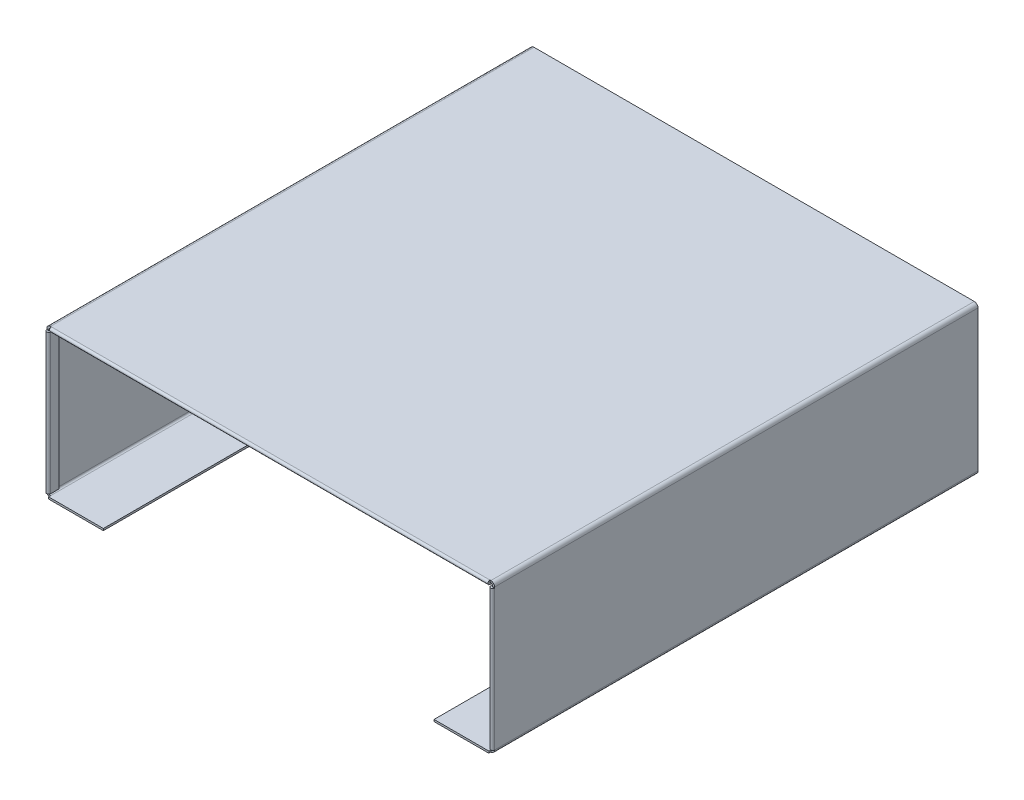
ISO-10303-21;
HEADER;
FILE_DESCRIPTION(('STEP AP214'),'2;1');
FILE_NAME('part.step','',(''),(''),'','','');
FILE_SCHEMA(('AUTOMOTIVE_DESIGN { 1 0 10303 214 1 1 1 1 }'));
ENDSEC;
DATA;
#1=APPLICATION_CONTEXT('core data for automotive mechanical design processes');
#2=APPLICATION_PROTOCOL_DEFINITION('international standard','automotive_design',2000,#1);
#3=PRODUCT_CONTEXT('',#1,'mechanical');
#4=PRODUCT('Part','Part','',(#3));
#5=PRODUCT_RELATED_PRODUCT_CATEGORY('part','',(#4));
#6=PRODUCT_DEFINITION_FORMATION('','',#4);
#7=PRODUCT_DEFINITION_CONTEXT('part definition',#1,'design');
#8=PRODUCT_DEFINITION('design','',#6,#7);
#9=PRODUCT_DEFINITION_SHAPE('','',#8);
#10=(LENGTH_UNIT() NAMED_UNIT(*) SI_UNIT(.MILLI.,.METRE.));
#11=(NAMED_UNIT(*) PLANE_ANGLE_UNIT() SI_UNIT($,.RADIAN.));
#12=(NAMED_UNIT(*) SI_UNIT($,.STERADIAN.) SOLID_ANGLE_UNIT());
#13=UNCERTAINTY_MEASURE_WITH_UNIT(LENGTH_MEASURE(1.E-05),#10,'distance_accuracy_value','');
#14=(GEOMETRIC_REPRESENTATION_CONTEXT(3) GLOBAL_UNCERTAINTY_ASSIGNED_CONTEXT((#13)) GLOBAL_UNIT_ASSIGNED_CONTEXT((#10,
#11,#12)) REPRESENTATION_CONTEXT('',''));
#15=CARTESIAN_POINT('',(0.,0.,0.));
#16=DIRECTION('',(0.,0.,1.));
#17=DIRECTION('',(1.,0.,0.));
#18=AXIS2_PLACEMENT_3D('',#15,#16,#17);
#19=CARTESIAN_POINT('',(-309.554281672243,-5.218,674.2752));
#20=DIRECTION('',(0.,0.,-1.));
#21=DIRECTION('',(-1.,0.,0.));
#22=AXIS2_PLACEMENT_3D('',#19,#20,#21);
#23=PLANE('',#22);
#24=DIRECTION('',(-1.,0.,0.));
#25=VECTOR('',#24,1.);
#26=CARTESIAN_POINT('',(-309.554281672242,-6.55919999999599,674.2752));
#27=LINE('',#26,#25);
#28=CARTESIAN_POINT('',(-309.554281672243,-6.55919999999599,674.2752));
#29=VERTEX_POINT('',#28);
#30=CARTESIAN_POINT('',(-312.232281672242,-6.55919999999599,674.2752));
#31=VERTEX_POINT('',#30);
#32=EDGE_CURVE('E63',#29,#31,#27,.T.);
#33=ORIENTED_EDGE('',*,*,#32,.F.);
#34=DIRECTION('',(0.,-1.,0.));
#35=VECTOR('',#34,1.);
#36=CARTESIAN_POINT('',(-309.554281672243,-5.218,674.2752));
#37=LINE('',#36,#35);
#38=CARTESIAN_POINT('',(-309.554281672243,-5.218,674.2752));
#39=VERTEX_POINT('',#38);
#40=EDGE_CURVE('E297',#39,#29,#37,.T.);
#41=ORIENTED_EDGE('',*,*,#40,.F.);
#42=DIRECTION('',(1.,0.,0.));
#43=VECTOR('',#42,1.);
#44=CARTESIAN_POINT('',(-312.232281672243,-5.218,674.2752));
#45=LINE('',#44,#43);
#46=CARTESIAN_POINT('',(-312.232281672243,-5.218,674.2752));
#47=VERTEX_POINT('',#46);
#48=EDGE_CURVE('E293',#47,#39,#45,.T.);
#49=ORIENTED_EDGE('',*,*,#48,.F.);
#50=DIRECTION('',(0.,-1.,0.));
#51=VECTOR('',#50,1.);
#52=CARTESIAN_POINT('',(-312.232281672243,0.,674.2752));
#53=LINE('',#52,#51);
#54=EDGE_CURVE('E291',#47,#31,#53,.T.);
#55=ORIENTED_EDGE('',*,*,#54,.T.);
#56=EDGE_LOOP('',(#33,#41,#49,#55));
#57=FACE_BOUND('',#56,.T.);
#58=ADVANCED_FACE('F46',(#57),#23,.F.);
#59=CARTESIAN_POINT('',(-307.014281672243,-207.242202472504,674.2752));
#60=DIRECTION('',(-1.,0.,0.));
#61=DIRECTION('',(0.,0.,1.));
#62=AXIS2_PLACEMENT_3D('',#59,#60,#61);
#63=PLANE('',#62);
#64=DIRECTION('',(0.,1.,0.));
#65=VECTOR('',#64,1.);
#66=CARTESIAN_POINT('',(-307.014281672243,-207.242202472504,674.2752));
#67=LINE('',#66,#65);
#68=CARTESIAN_POINT('',(-307.014281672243,-207.242202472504,674.2752));
#69=VERTEX_POINT('',#68);
#70=CARTESIAN_POINT('',(-307.014281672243,-204.564202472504,674.2752));
#71=VERTEX_POINT('',#70);
#72=EDGE_CURVE('E13',#69,#71,#67,.T.);
#73=ORIENTED_EDGE('',*,*,#72,.F.);
#74=DIRECTION('',(0.,0.,-1.));
#75=VECTOR('',#74,1.);
#76=CARTESIAN_POINT('',(-307.014281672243,-207.242202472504,677.004));
#77=LINE('',#76,#75);
#78=CARTESIAN_POINT('',(-307.014281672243,-207.242202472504,677.004));
#79=VERTEX_POINT('',#78);
#80=EDGE_CURVE('E1346',#79,#69,#77,.T.);
#81=ORIENTED_EDGE('',*,*,#80,.F.);
#82=DIRECTION('',(0.,-1.,0.));
#83=VECTOR('',#82,1.);
#84=CARTESIAN_POINT('',(-307.014281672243,-204.564202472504,677.004));
#85=LINE('',#84,#83);
#86=CARTESIAN_POINT('',(-307.014281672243,-204.564202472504,677.004));
#87=VERTEX_POINT('',#86);
#88=EDGE_CURVE('E1319',#87,#79,#85,.T.);
#89=ORIENTED_EDGE('',*,*,#88,.F.);
#90=DIRECTION('',(0.,0.,-1.));
#91=VECTOR('',#90,1.);
#92=CARTESIAN_POINT('',(-307.014281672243,-204.564202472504,677.004));
#93=LINE('',#92,#91);
#94=EDGE_CURVE('E1354',#87,#71,#93,.T.);
#95=ORIENTED_EDGE('',*,*,#94,.T.);
#96=EDGE_LOOP('',(#73,#81,#89,#95));
#97=FACE_BOUND('',#96,.T.);
#98=ADVANCED_FACE('F48',(#97),#63,.T.);
#99=CARTESIAN_POINT('',(-307.014281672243,-202.024202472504,677.004));
#100=DIRECTION('',(0.,0.,-1.));
#101=DIRECTION('',(-1.,0.,0.));
#102=AXIS2_PLACEMENT_3D('',#99,#100,#101);
#103=CYLINDRICAL_SURFACE('',#102,5.218);
#104=CARTESIAN_POINT('',(-307.014281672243,-207.242202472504,0.));
#105=VERTEX_POINT('',#104);
#106=EDGE_CURVE('E1349',#69,#105,#77,.T.);
#107=ORIENTED_EDGE('',*,*,#106,.F.);
#108=CARTESIAN_POINT('',(-307.014281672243,-202.024202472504,674.2752));
#109=DIRECTION('',(0.,0.,1.));
#110=DIRECTION('',(1.,0.,0.));
#111=AXIS2_PLACEMENT_3D('',#108,#109,#110);
#112=CIRCLE('',#111,5.218);
#113=CARTESIAN_POINT('',(-312.232281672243,-202.024202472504,674.2752));
#114=VERTEX_POINT('',#113);
#115=EDGE_CURVE('E389',#69,#114,#112,.F.);
#116=ORIENTED_EDGE('',*,*,#115,.T.);
#117=DIRECTION('',(0.,0.,-1.));
#118=VECTOR('',#117,1.);
#119=CARTESIAN_POINT('',(-312.232281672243,-202.024202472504,677.004));
#120=LINE('',#119,#118);
#121=CARTESIAN_POINT('',(-312.232281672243,-202.024202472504,0.));
#122=VERTEX_POINT('',#121);
#123=EDGE_CURVE('E304',#114,#122,#120,.T.);
#124=ORIENTED_EDGE('',*,*,#123,.T.);
#125=CARTESIAN_POINT('',(-307.014281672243,-202.024202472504,0.));
#126=DIRECTION('',(0.,0.,-1.));
#127=DIRECTION('',(-1.,0.,0.));
#128=AXIS2_PLACEMENT_3D('',#125,#126,#127);
#129=CIRCLE('',#128,5.218);
#130=EDGE_CURVE('E1395',#105,#122,#129,.T.);
#131=ORIENTED_EDGE('',*,*,#130,.F.);
#132=EDGE_LOOP('',(#107,#116,#124,#131));
#133=FACE_BOUND('',#132,.T.);
#134=ADVANCED_FACE('F468',(#133),#103,.T.);
#135=CARTESIAN_POINT('',(307.014281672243,-204.564202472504,674.2752));
#136=DIRECTION('',(1.,0.,0.));
#137=DIRECTION('',(0.,0.,-1.));
#138=AXIS2_PLACEMENT_3D('',#135,#136,#137);
#139=PLANE('',#138);
#140=DIRECTION('',(0.,-1.,0.));
#141=VECTOR('',#140,1.);
#142=CARTESIAN_POINT('',(307.014281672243,-204.564202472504,674.2752));
#143=LINE('',#142,#141);
#144=CARTESIAN_POINT('',(307.014281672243,-204.564202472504,674.2752));
#145=VERTEX_POINT('',#144);
#146=CARTESIAN_POINT('',(307.014281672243,-207.242202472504,674.2752));
#147=VERTEX_POINT('',#146);
#148=EDGE_CURVE('E391',#145,#147,#143,.T.);
#149=ORIENTED_EDGE('',*,*,#148,.F.);
#150=DIRECTION('',(0.,0.,-1.));
#151=VECTOR('',#150,1.);
#152=CARTESIAN_POINT('',(307.014281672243,-204.564202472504,677.004));
#153=LINE('',#152,#151);
#154=CARTESIAN_POINT('',(307.014281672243,-204.564202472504,677.004));
#155=VERTEX_POINT('',#154);
#156=EDGE_CURVE('E1365',#155,#145,#153,.T.);
#157=ORIENTED_EDGE('',*,*,#156,.F.);
#158=DIRECTION('',(0.,1.,0.));
#159=VECTOR('',#158,1.);
#160=CARTESIAN_POINT('',(307.014281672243,-207.242202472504,677.004));
#161=LINE('',#160,#159);
#162=CARTESIAN_POINT('',(307.014281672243,-207.242202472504,677.004));
#163=VERTEX_POINT('',#162);
#164=EDGE_CURVE('E1299',#163,#155,#161,.T.);
#165=ORIENTED_EDGE('',*,*,#164,.F.);
#166=DIRECTION('',(0.,0.,-1.));
#167=VECTOR('',#166,1.);
#168=CARTESIAN_POINT('',(307.014281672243,-207.242202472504,677.004));
#169=LINE('',#168,#167);
#170=EDGE_CURVE('E1331',#163,#147,#169,.T.);
#171=ORIENTED_EDGE('',*,*,#170,.T.);
#172=EDGE_LOOP('',(#149,#157,#165,#171));
#173=FACE_BOUND('',#172,.T.);
#174=ADVANCED_FACE('F593',(#173),#139,.T.);
#175=CARTESIAN_POINT('',(307.014281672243,-202.024202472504,677.004));
#176=DIRECTION('',(0.,0.,-1.));
#177=DIRECTION('',(-1.,0.,0.));
#178=AXIS2_PLACEMENT_3D('',#175,#176,#177);
#179=CYLINDRICAL_SURFACE('',#178,5.218);
#180=DIRECTION('',(0.,0.,-1.));
#181=VECTOR('',#180,1.);
#182=CARTESIAN_POINT('',(312.232281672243,-202.024202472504,677.004));
#183=LINE('',#182,#181);
#184=CARTESIAN_POINT('',(312.232281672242,-202.024202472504,674.2752));
#185=VERTEX_POINT('',#184);
#186=CARTESIAN_POINT('',(312.232281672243,-202.024202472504,0.));
#187=VERTEX_POINT('',#186);
#188=EDGE_CURVE('E1335',#185,#187,#183,.T.);
#189=ORIENTED_EDGE('',*,*,#188,.F.);
#190=CARTESIAN_POINT('',(307.014281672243,-202.024202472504,674.2752));
#191=DIRECTION('',(0.,0.,1.));
#192=DIRECTION('',(1.,0.,0.));
#193=AXIS2_PLACEMENT_3D('',#190,#191,#192);
#194=CIRCLE('',#193,5.218);
#195=EDGE_CURVE('E1493',#185,#147,#194,.F.);
#196=ORIENTED_EDGE('',*,*,#195,.T.);
#197=CARTESIAN_POINT('',(307.014281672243,-207.242202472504,0.));
#198=VERTEX_POINT('',#197);
#199=EDGE_CURVE('E1334',#147,#198,#169,.T.);
#200=ORIENTED_EDGE('',*,*,#199,.T.);
#201=CARTESIAN_POINT('',(307.014281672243,-202.024202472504,0.));
#202=DIRECTION('',(0.,0.,-1.));
#203=DIRECTION('',(-1.,0.,0.));
#204=AXIS2_PLACEMENT_3D('',#201,#202,#203);
#205=CIRCLE('',#204,5.218);
#206=EDGE_CURVE('E1413',#187,#198,#205,.T.);
#207=ORIENTED_EDGE('',*,*,#206,.F.);
#208=EDGE_LOOP('',(#189,#196,#200,#207));
#209=FACE_BOUND('',#208,.T.);
#210=ADVANCED_FACE('F617',(#209),#179,.T.);
#211=CARTESIAN_POINT('',(307.014281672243,-202.024202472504,674.2752));
#212=DIRECTION('',(0.,0.,1.));
#213=DIRECTION('',(1.,0.,0.));
#214=AXIS2_PLACEMENT_3D('',#211,#212,#213);
#215=PLANE('',#214);
#216=CARTESIAN_POINT('',(307.014281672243,-202.024202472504,674.2752));
#217=DIRECTION('',(0.,0.,1.));
#218=DIRECTION('',(1.,0.,0.));
#219=AXIS2_PLACEMENT_3D('',#216,#217,#218);
#220=CIRCLE('',#219,2.54);
#221=CARTESIAN_POINT('',(309.554281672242,-202.024202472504,674.2752));
#222=VERTEX_POINT('',#221);
#223=EDGE_CURVE('E1285',#222,#145,#220,.F.);
#224=ORIENTED_EDGE('',*,*,#223,.T.);
#225=ORIENTED_EDGE('',*,*,#148,.T.);
#226=ORIENTED_EDGE('',*,*,#195,.F.);
#227=DIRECTION('',(1.,0.,0.));
#228=VECTOR('',#227,1.);
#229=CARTESIAN_POINT('',(309.554281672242,-202.024202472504,674.2752));
#230=LINE('',#229,#228);
#231=EDGE_CURVE('E369',#222,#185,#230,.T.);
#232=ORIENTED_EDGE('',*,*,#231,.F.);
#233=EDGE_LOOP('',(#224,#225,#226,#232));
#234=FACE_BOUND('',#233,.T.);
#235=ADVANCED_FACE('F620',(#234),#215,.T.);
#236=CARTESIAN_POINT('',(307.014281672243,-2.678,674.2752));
#237=DIRECTION('',(0.,0.,-1.));
#238=DIRECTION('',(0.,1.,0.));
#239=AXIS2_PLACEMENT_3D('',#236,#237,#238);
#240=PLANE('',#239);
#241=DIRECTION('',(0.,1.,0.));
#242=VECTOR('',#241,1.);
#243=CARTESIAN_POINT('',(305.673081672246,-2.678,674.2752));
#244=LINE('',#243,#242);
#245=CARTESIAN_POINT('',(305.673081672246,-2.678,674.2752));
#246=VERTEX_POINT('',#245);
#247=CARTESIAN_POINT('',(305.673081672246,0.,674.2752));
#248=VERTEX_POINT('',#247);
#249=EDGE_CURVE('E1238',#246,#248,#244,.T.);
#250=ORIENTED_EDGE('',*,*,#249,.F.);
#251=DIRECTION('',(-1.,0.,0.));
#252=VECTOR('',#251,1.);
#253=CARTESIAN_POINT('',(307.014281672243,-2.678,674.2752));
#254=LINE('',#253,#252);
#255=CARTESIAN_POINT('',(307.014281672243,-2.678,674.2752));
#256=VERTEX_POINT('',#255);
#257=EDGE_CURVE('E1241',#256,#246,#254,.T.);
#258=ORIENTED_EDGE('',*,*,#257,.F.);
#259=DIRECTION('',(0.,1.,0.));
#260=VECTOR('',#259,1.);
#261=CARTESIAN_POINT('',(307.014281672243,-2.678,674.2752));
#262=LINE('',#261,#260);
#263=CARTESIAN_POINT('',(307.014281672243,0.,674.2752));
#264=VERTEX_POINT('',#263);
#265=EDGE_CURVE('E1259',#256,#264,#262,.T.);
#266=ORIENTED_EDGE('',*,*,#265,.T.);
#267=DIRECTION('',(-1.,0.,0.));
#268=VECTOR('',#267,1.);
#269=CARTESIAN_POINT('',(-312.232281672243,0.,674.2752));
#270=LINE('',#269,#268);
#271=EDGE_CURVE('E1244',#264,#248,#270,.T.);
#272=ORIENTED_EDGE('',*,*,#271,.T.);
#273=EDGE_LOOP('',(#250,#258,#266,#272));
#274=FACE_BOUND('',#273,.T.);
#275=ADVANCED_FACE('F546',(#274),#240,.F.);
#276=CARTESIAN_POINT('',(307.014281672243,-5.218,677.004));
#277=DIRECTION('',(0.,0.,-1.));
#278=DIRECTION('',(-1.,0.,0.));
#279=AXIS2_PLACEMENT_3D('',#276,#277,#278);
#280=CYLINDRICAL_SURFACE('',#279,5.218);
#281=DIRECTION('',(0.,0.,-1.));
#282=VECTOR('',#281,1.);
#283=CARTESIAN_POINT('',(307.014281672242,0.,677.004));
#284=LINE('',#283,#282);
#285=CARTESIAN_POINT('',(307.014281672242,0.,0.));
#286=VERTEX_POINT('',#285);
#287=EDGE_CURVE('E1339',#264,#286,#284,.T.);
#288=ORIENTED_EDGE('',*,*,#287,.F.);
#289=CARTESIAN_POINT('',(307.014281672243,-5.218,674.2752));
#290=DIRECTION('',(0.,0.,1.));
#291=DIRECTION('',(0.,-1.,0.));
#292=AXIS2_PLACEMENT_3D('',#289,#290,#291);
#293=CIRCLE('',#292,5.218);
#294=CARTESIAN_POINT('',(312.232281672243,-5.218,674.2752));
#295=VERTEX_POINT('',#294);
#296=EDGE_CURVE('E1286',#264,#295,#293,.F.);
#297=ORIENTED_EDGE('',*,*,#296,.T.);
#298=DIRECTION('',(0.,0.,-1.));
#299=VECTOR('',#298,1.);
#300=CARTESIAN_POINT('',(312.232281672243,-5.218,677.004));
#301=LINE('',#300,#299);
#302=CARTESIAN_POINT('',(312.232281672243,-5.218,0.));
#303=VERTEX_POINT('',#302);
#304=EDGE_CURVE('E1337',#295,#303,#301,.T.);
#305=ORIENTED_EDGE('',*,*,#304,.T.);
#306=CARTESIAN_POINT('',(307.014281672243,-5.218,0.));
#307=DIRECTION('',(0.,0.,-1.));
#308=DIRECTION('',(-1.,0.,0.));
#309=AXIS2_PLACEMENT_3D('',#306,#307,#308);
#310=CIRCLE('',#309,5.218);
#311=EDGE_CURVE('E1407',#286,#303,#310,.T.);
#312=ORIENTED_EDGE('',*,*,#311,.F.);
#313=EDGE_LOOP('',(#288,#297,#305,#312));
#314=FACE_BOUND('',#313,.T.);
#315=ADVANCED_FACE('F609',(#314),#280,.T.);
#316=CARTESIAN_POINT('',(307.014281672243,-5.218,674.2752));
#317=DIRECTION('',(0.,0.,1.));
#318=DIRECTION('',(0.,-1.,0.));
#319=AXIS2_PLACEMENT_3D('',#316,#317,#318);
#320=PLANE('',#319);
#321=CARTESIAN_POINT('',(307.014281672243,-5.218,674.2752));
#322=DIRECTION('',(0.,0.,1.));
#323=DIRECTION('',(0.,-1.,0.));
#324=AXIS2_PLACEMENT_3D('',#321,#322,#323);
#325=CIRCLE('',#324,2.54);
#326=CARTESIAN_POINT('',(309.554281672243,-5.218,674.2752));
#327=VERTEX_POINT('',#326);
#328=EDGE_CURVE('E1289',#256,#327,#325,.F.);
#329=ORIENTED_EDGE('',*,*,#328,.T.);
#330=DIRECTION('',(1.,0.,0.));
#331=VECTOR('',#330,1.);
#332=CARTESIAN_POINT('',(309.554281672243,-5.218,674.2752));
#333=LINE('',#332,#331);
#334=EDGE_CURVE('E1282',#327,#295,#333,.T.);
#335=ORIENTED_EDGE('',*,*,#334,.T.);
#336=ORIENTED_EDGE('',*,*,#296,.F.);
#337=ORIENTED_EDGE('',*,*,#265,.F.);
#338=EDGE_LOOP('',(#329,#335,#336,#337));
#339=FACE_BOUND('',#338,.T.);
#340=ADVANCED_FACE('F602',(#339),#320,.T.);
#341=CARTESIAN_POINT('',(-307.014281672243,-5.218,677.004));
#342=DIRECTION('',(0.,0.,-1.));
#343=DIRECTION('',(-1.,0.,0.));
#344=AXIS2_PLACEMENT_3D('',#341,#342,#343);
#345=CYLINDRICAL_SURFACE('',#344,5.218);
#346=DIRECTION('',(0.,0.,-1.));
#347=VECTOR('',#346,1.);
#348=CARTESIAN_POINT('',(-312.232281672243,-5.218,677.004));
#349=LINE('',#348,#347);
#350=CARTESIAN_POINT('',(-312.232281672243,-5.218,0.));
#351=VERTEX_POINT('',#350);
#352=EDGE_CURVE('E1343',#47,#351,#349,.T.);
#353=ORIENTED_EDGE('',*,*,#352,.F.);
#354=CARTESIAN_POINT('',(-307.014281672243,-5.218,674.2752));
#355=DIRECTION('',(0.,0.,1.));
#356=DIRECTION('',(0.,-1.,0.));
#357=AXIS2_PLACEMENT_3D('',#354,#355,#356);
#358=CIRCLE('',#357,5.218);
#359=CARTESIAN_POINT('',(-307.014281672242,0.,674.2752));
#360=VERTEX_POINT('',#359);
#361=EDGE_CURVE('E1296',#47,#360,#358,.F.);
#362=ORIENTED_EDGE('',*,*,#361,.T.);
#363=DIRECTION('',(0.,0.,-1.));
#364=VECTOR('',#363,1.);
#365=CARTESIAN_POINT('',(-307.014281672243,0.,677.004));
#366=LINE('',#365,#364);
#367=CARTESIAN_POINT('',(-307.014281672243,0.,0.));
#368=VERTEX_POINT('',#367);
#369=EDGE_CURVE('E1341',#360,#368,#366,.T.);
#370=ORIENTED_EDGE('',*,*,#369,.T.);
#371=CARTESIAN_POINT('',(-307.014281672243,-5.218,0.));
#372=DIRECTION('',(0.,0.,-1.));
#373=DIRECTION('',(-1.,0.,0.));
#374=AXIS2_PLACEMENT_3D('',#371,#372,#373);
#375=CIRCLE('',#374,5.218);
#376=EDGE_CURVE('E1401',#351,#368,#375,.T.);
#377=ORIENTED_EDGE('',*,*,#376,.F.);
#378=EDGE_LOOP('',(#353,#362,#370,#377));
#379=FACE_BOUND('',#378,.T.);
#380=ADVANCED_FACE('F598',(#379),#345,.T.);
#381=CARTESIAN_POINT('',(309.554281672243,-202.024202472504,677.004));
#382=DIRECTION('',(0.,0.,1.));
#383=DIRECTION('',(1.,0.,0.));
#384=AXIS2_PLACEMENT_3D('',#381,#382,#383);
#385=PLANE('',#384);
#386=DIRECTION('',(-1.,0.,0.));
#387=VECTOR('',#386,1.);
#388=CARTESIAN_POINT('',(312.232281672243,-207.242202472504,677.004));
#389=LINE('',#388,#387);
#390=CARTESIAN_POINT('',(230.620133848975,-207.242202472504,677.004));
#391=VERTEX_POINT('',#390);
#392=EDGE_CURVE('E1433',#163,#391,#389,.T.);
#393=ORIENTED_EDGE('',*,*,#392,.F.);
#394=ORIENTED_EDGE('',*,*,#164,.T.);
#395=DIRECTION('',(-1.,0.,0.));
#396=VECTOR('',#395,1.);
#397=CARTESIAN_POINT('',(312.232281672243,-204.564202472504,677.004));
#398=LINE('',#397,#396);
#399=CARTESIAN_POINT('',(230.620133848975,-204.564202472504,677.004));
#400=VERTEX_POINT('',#399);
#401=EDGE_CURVE('E1277',#155,#400,#398,.T.);
#402=ORIENTED_EDGE('',*,*,#401,.T.);
#403=DIRECTION('',(0.,1.,0.));
#404=VECTOR('',#403,1.);
#405=CARTESIAN_POINT('',(230.620133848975,-207.242202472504,677.004));
#406=LINE('',#405,#404);
#407=EDGE_CURVE('E1435',#391,#400,#406,.T.);
#408=ORIENTED_EDGE('',*,*,#407,.F.);
#409=EDGE_LOOP('',(#393,#394,#402,#408));
#410=FACE_BOUND('',#409,.T.);
#411=ADVANCED_FACE('F601',(#410),#385,.T.);
#412=CARTESIAN_POINT('',(312.232281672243,-202.024202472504,0.));
#413=DIRECTION('',(0.,0.,-1.));
#414=DIRECTION('',(-1.,0.,0.));
#415=AXIS2_PLACEMENT_3D('',#412,#413,#414);
#416=PLANE('',#415);
#417=DIRECTION('',(-1.,0.,0.));
#418=VECTOR('',#417,1.);
#419=CARTESIAN_POINT('',(312.232281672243,-202.024202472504,0.));
#420=LINE('',#419,#418);
#421=CARTESIAN_POINT('',(309.554281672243,-202.024202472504,0.));
#422=VERTEX_POINT('',#421);
#423=EDGE_CURVE('E1301',#187,#422,#420,.T.);
#424=ORIENTED_EDGE('',*,*,#423,.F.);
#425=ORIENTED_EDGE('',*,*,#206,.T.);
#426=DIRECTION('',(0.,-1.,0.));
#427=VECTOR('',#426,1.);
#428=CARTESIAN_POINT('',(307.014281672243,-204.564202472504,0.));
#429=LINE('',#428,#427);
#430=CARTESIAN_POINT('',(307.014281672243,-204.564202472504,0.));
#431=VERTEX_POINT('',#430);
#432=EDGE_CURVE('E1304',#431,#198,#429,.T.);
#433=ORIENTED_EDGE('',*,*,#432,.F.);
#434=CARTESIAN_POINT('',(307.014281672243,-202.024202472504,0.));
#435=DIRECTION('',(0.,0.,1.));
#436=DIRECTION('',(1.,0.,0.));
#437=AXIS2_PLACEMENT_3D('',#434,#435,#436);
#438=CIRCLE('',#437,2.54);
#439=EDGE_CURVE('E1369',#422,#431,#438,.F.);
#440=ORIENTED_EDGE('',*,*,#439,.F.);
#441=EDGE_LOOP('',(#424,#425,#433,#440));
#442=FACE_BOUND('',#441,.T.);
#443=ADVANCED_FACE('F660',(#442),#416,.T.);
#444=CARTESIAN_POINT('',(307.014281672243,-204.564202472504,0.));
#445=DIRECTION('',(0.,0.,-1.));
#446=DIRECTION('',(-1.,0.,0.));
#447=AXIS2_PLACEMENT_3D('',#444,#445,#446);
#448=PLANE('',#447);
#449=DIRECTION('',(0.,-1.,0.));
#450=VECTOR('',#449,1.);
#451=CARTESIAN_POINT('',(312.232281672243,0.,0.));
#452=LINE('',#451,#450);
#453=EDGE_CURVE('E1410',#303,#187,#452,.T.);
#454=ORIENTED_EDGE('',*,*,#453,.T.);
#455=ORIENTED_EDGE('',*,*,#423,.T.);
#456=DIRECTION('',(0.,1.,0.));
#457=VECTOR('',#456,1.);
#458=CARTESIAN_POINT('',(309.554281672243,0.,0.));
#459=LINE('',#458,#457);
#460=CARTESIAN_POINT('',(309.554281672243,-5.218,0.));
#461=VERTEX_POINT('',#460);
#462=EDGE_CURVE('E1372',#461,#422,#459,.F.);
#463=ORIENTED_EDGE('',*,*,#462,.F.);
#464=DIRECTION('',(1.,0.,0.));
#465=VECTOR('',#464,1.);
#466=CARTESIAN_POINT('',(309.554281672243,-5.218,0.));
#467=LINE('',#466,#465);
#468=EDGE_CURVE('E1310',#461,#303,#467,.T.);
#469=ORIENTED_EDGE('',*,*,#468,.T.);
#470=EDGE_LOOP('',(#454,#455,#463,#469));
#471=FACE_BOUND('',#470,.T.);
#472=ADVANCED_FACE('F656',(#471),#448,.T.);
#473=CARTESIAN_POINT('',(307.014281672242,0.,0.));
#474=DIRECTION('',(0.,0.,-1.));
#475=DIRECTION('',(-1.,0.,0.));
#476=AXIS2_PLACEMENT_3D('',#473,#474,#475);
#477=PLANE('',#476);
#478=DIRECTION('',(0.,-1.,0.));
#479=VECTOR('',#478,1.);
#480=CARTESIAN_POINT('',(307.014281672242,0.,0.));
#481=LINE('',#480,#479);
#482=CARTESIAN_POINT('',(307.014281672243,-2.678,0.));
#483=VERTEX_POINT('',#482);
#484=EDGE_CURVE('E1307',#286,#483,#481,.T.);
#485=ORIENTED_EDGE('',*,*,#484,.F.);
#486=ORIENTED_EDGE('',*,*,#311,.T.);
#487=ORIENTED_EDGE('',*,*,#468,.F.);
#488=CARTESIAN_POINT('',(307.014281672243,-5.218,0.));
#489=DIRECTION('',(0.,0.,1.));
#490=DIRECTION('',(1.,0.,0.));
#491=AXIS2_PLACEMENT_3D('',#488,#489,#490);
#492=CIRCLE('',#491,2.54);
#493=EDGE_CURVE('E1375',#483,#461,#492,.F.);
#494=ORIENTED_EDGE('',*,*,#493,.F.);
#495=EDGE_LOOP('',(#485,#486,#487,#494));
#496=FACE_BOUND('',#495,.T.);
#497=ADVANCED_FACE('F652',(#496),#477,.T.);
#498=CARTESIAN_POINT('',(309.554281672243,-5.218,0.));
#499=DIRECTION('',(0.,0.,-1.));
#500=DIRECTION('',(-1.,0.,0.));
#501=AXIS2_PLACEMENT_3D('',#498,#499,#500);
#502=PLANE('',#501);
#503=DIRECTION('',(1.,0.,0.));
#504=VECTOR('',#503,1.);
#505=CARTESIAN_POINT('',(-312.232281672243,0.,0.));
#506=LINE('',#505,#504);
#507=EDGE_CURVE('E1404',#368,#286,#506,.T.);
#508=ORIENTED_EDGE('',*,*,#507,.T.);
#509=ORIENTED_EDGE('',*,*,#484,.T.);
#510=DIRECTION('',(1.,0.,0.));
#511=VECTOR('',#510,1.);
#512=CARTESIAN_POINT('',(-312.232281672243,-2.678,0.));
#513=LINE('',#512,#511);
#514=CARTESIAN_POINT('',(-307.014281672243,-2.678,0.));
#515=VERTEX_POINT('',#514);
#516=EDGE_CURVE('E1378',#515,#483,#513,.T.);
#517=ORIENTED_EDGE('',*,*,#516,.F.);
#518=DIRECTION('',(0.,1.,0.));
#519=VECTOR('',#518,1.);
#520=CARTESIAN_POINT('',(-307.014281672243,-2.678,0.));
#521=LINE('',#520,#519);
#522=EDGE_CURVE('E1316',#515,#368,#521,.T.);
#523=ORIENTED_EDGE('',*,*,#522,.T.);
#524=EDGE_LOOP('',(#508,#509,#517,#523));
#525=FACE_BOUND('',#524,.T.);
#526=ADVANCED_FACE('F648',(#525),#502,.T.);
#527=CARTESIAN_POINT('',(-312.232281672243,-5.218,0.));
#528=DIRECTION('',(0.,0.,-1.));
#529=DIRECTION('',(-1.,0.,0.));
#530=AXIS2_PLACEMENT_3D('',#527,#528,#529);
#531=PLANE('',#530);
#532=DIRECTION('',(1.,0.,0.));
#533=VECTOR('',#532,1.);
#534=CARTESIAN_POINT('',(-312.232281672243,-5.218,0.));
#535=LINE('',#534,#533);
#536=CARTESIAN_POINT('',(-309.554281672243,-5.218,0.));
#537=VERTEX_POINT('',#536);
#538=EDGE_CURVE('E1313',#351,#537,#535,.T.);
#539=ORIENTED_EDGE('',*,*,#538,.F.);
#540=ORIENTED_EDGE('',*,*,#376,.T.);
#541=ORIENTED_EDGE('',*,*,#522,.F.);
#542=CARTESIAN_POINT('',(-307.014281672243,-5.218,0.));
#543=DIRECTION('',(0.,0.,1.));
#544=DIRECTION('',(1.,0.,0.));
#545=AXIS2_PLACEMENT_3D('',#542,#543,#544);
#546=CIRCLE('',#545,2.54);
#547=EDGE_CURVE('E1380',#537,#515,#546,.F.);
#548=ORIENTED_EDGE('',*,*,#547,.F.);
#549=EDGE_LOOP('',(#539,#540,#541,#548));
#550=FACE_BOUND('',#549,.T.);
#551=ADVANCED_FACE('F644',(#550),#531,.T.);
#552=CARTESIAN_POINT('',(-307.014281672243,-2.678,0.));
#553=DIRECTION('',(0.,0.,-1.));
#554=DIRECTION('',(-1.,0.,0.));
#555=AXIS2_PLACEMENT_3D('',#552,#553,#554);
#556=PLANE('',#555);
#557=DIRECTION('',(0.,1.,0.));
#558=VECTOR('',#557,1.);
#559=CARTESIAN_POINT('',(-312.232281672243,0.,0.));
#560=LINE('',#559,#558);
#561=EDGE_CURVE('E1398',#122,#351,#560,.T.);
#562=ORIENTED_EDGE('',*,*,#561,.T.);
#563=ORIENTED_EDGE('',*,*,#538,.T.);
#564=DIRECTION('',(0.,1.,0.));
#565=VECTOR('',#564,1.);
#566=CARTESIAN_POINT('',(-309.554281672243,0.,0.));
#567=LINE('',#566,#565);
#568=CARTESIAN_POINT('',(-309.554281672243,-202.024202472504,0.));
#569=VERTEX_POINT('',#568);
#570=EDGE_CURVE('E1383',#569,#537,#567,.T.);
#571=ORIENTED_EDGE('',*,*,#570,.F.);
#572=DIRECTION('',(-1.,0.,0.));
#573=VECTOR('',#572,1.);
#574=CARTESIAN_POINT('',(-309.554281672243,-202.024202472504,0.));
#575=LINE('',#574,#573);
#576=EDGE_CURVE('E1324',#569,#122,#575,.T.);
#577=ORIENTED_EDGE('',*,*,#576,.T.);
#578=EDGE_LOOP('',(#562,#563,#571,#577));
#579=FACE_BOUND('',#578,.T.);
#580=ADVANCED_FACE('F640',(#579),#556,.T.);
#581=CARTESIAN_POINT('',(-307.014281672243,-207.242202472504,0.));
#582=DIRECTION('',(0.,0.,-1.));
#583=DIRECTION('',(-1.,0.,0.));
#584=AXIS2_PLACEMENT_3D('',#581,#582,#583);
#585=PLANE('',#584);
#586=DIRECTION('',(0.,1.,0.));
#587=VECTOR('',#586,1.);
#588=CARTESIAN_POINT('',(-307.014281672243,-207.242202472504,0.));
#589=LINE('',#588,#587);
#590=CARTESIAN_POINT('',(-307.014281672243,-204.564202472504,0.));
#591=VERTEX_POINT('',#590);
#592=EDGE_CURVE('E1321',#105,#591,#589,.T.);
#593=ORIENTED_EDGE('',*,*,#592,.F.);
#594=ORIENTED_EDGE('',*,*,#130,.T.);
#595=ORIENTED_EDGE('',*,*,#576,.F.);
#596=CARTESIAN_POINT('',(-307.014281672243,-202.024202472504,0.));
#597=DIRECTION('',(0.,0.,1.));
#598=DIRECTION('',(1.,0.,0.));
#599=AXIS2_PLACEMENT_3D('',#596,#597,#598);
#600=CIRCLE('',#599,2.54);
#601=EDGE_CURVE('E400',#591,#569,#600,.F.);
#602=ORIENTED_EDGE('',*,*,#601,.F.);
#603=EDGE_LOOP('',(#593,#594,#595,#602));
#604=FACE_BOUND('',#603,.T.);
#605=ADVANCED_FACE('F636',(#604),#585,.T.);
#606=CARTESIAN_POINT('',(-309.554281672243,-202.024202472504,0.));
#607=DIRECTION('',(0.,0.,-1.));
#608=DIRECTION('',(-1.,0.,0.));
#609=AXIS2_PLACEMENT_3D('',#606,#607,#608);
#610=PLANE('',#609);
#611=DIRECTION('',(-1.,0.,0.));
#612=VECTOR('',#611,1.);
#613=CARTESIAN_POINT('',(-312.232281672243,-207.242202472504,0.));
#614=LINE('',#613,#612);
#615=CARTESIAN_POINT('',(-230.620133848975,-207.242202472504,0.));
#616=VERTEX_POINT('',#615);
#617=EDGE_CURVE('E1392',#616,#105,#614,.T.);
#618=ORIENTED_EDGE('',*,*,#617,.T.);
#619=ORIENTED_EDGE('',*,*,#592,.T.);
#620=DIRECTION('',(-1.,0.,0.));
#621=VECTOR('',#620,1.);
#622=CARTESIAN_POINT('',(-312.232281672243,-204.564202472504,0.));
#623=LINE('',#622,#621);
#624=CARTESIAN_POINT('',(-230.620133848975,-204.564202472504,0.));
#625=VERTEX_POINT('',#624);
#626=EDGE_CURVE('E1386',#625,#591,#623,.T.);
#627=ORIENTED_EDGE('',*,*,#626,.F.);
#628=DIRECTION('',(0.,-1.,0.));
#629=VECTOR('',#628,1.);
#630=CARTESIAN_POINT('',(-230.620133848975,-204.564202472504,0.));
#631=LINE('',#630,#629);
#632=EDGE_CURVE('E1389',#625,#616,#631,.T.);
#633=ORIENTED_EDGE('',*,*,#632,.T.);
#634=EDGE_LOOP('',(#618,#619,#627,#633));
#635=FACE_BOUND('',#634,.T.);
#636=ADVANCED_FACE('F632',(#635),#610,.T.);
#637=CARTESIAN_POINT('',(312.232281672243,-204.564202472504,677.004));
#638=DIRECTION('',(0.,-1.,0.));
#639=DIRECTION('',(1.,0.,0.));
#640=AXIS2_PLACEMENT_3D('',#637,#638,#639);
#641=PLANE('',#640);
#642=DIRECTION('',(-1.,0.,0.));
#643=VECTOR('',#642,1.);
#644=CARTESIAN_POINT('',(312.232281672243,-204.564202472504,0.));
#645=LINE('',#644,#643);
#646=CARTESIAN_POINT('',(230.620133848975,-204.564202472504,0.));
#647=VERTEX_POINT('',#646);
#648=EDGE_CURVE('E1281',#431,#647,#645,.T.);
#649=ORIENTED_EDGE('',*,*,#648,.T.);
#650=DIRECTION('',(0.,0.,-1.));
#651=VECTOR('',#650,1.);
#652=CARTESIAN_POINT('',(230.620133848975,-204.564202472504,677.004));
#653=LINE('',#652,#651);
#654=EDGE_CURVE('E1327',#400,#647,#653,.T.);
#655=ORIENTED_EDGE('',*,*,#654,.F.);
#656=ORIENTED_EDGE('',*,*,#401,.F.);
#657=ORIENTED_EDGE('',*,*,#156,.T.);
#658=EDGE_CURVE('E1368',#145,#431,#153,.T.);
#659=ORIENTED_EDGE('',*,*,#658,.T.);
#660=EDGE_LOOP('',(#649,#655,#656,#657,#659));
#661=FACE_BOUND('',#660,.T.);
#662=ADVANCED_FACE('F628',(#661),#641,.F.);
#663=CARTESIAN_POINT('',(230.620133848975,-207.242202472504,677.004));
#664=DIRECTION('',(-1.,0.,0.));
#665=DIRECTION('',(0.,0.,1.));
#666=AXIS2_PLACEMENT_3D('',#663,#664,#665);
#667=PLANE('',#666);
#668=DIRECTION('',(0.,1.,0.));
#669=VECTOR('',#668,1.);
#670=CARTESIAN_POINT('',(230.620133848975,-207.242202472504,0.));
#671=LINE('',#670,#669);
#672=CARTESIAN_POINT('',(230.620133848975,-207.242202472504,0.));
#673=VERTEX_POINT('',#672);
#674=EDGE_CURVE('E1419',#673,#647,#671,.T.);
#675=ORIENTED_EDGE('',*,*,#674,.F.);
#676=DIRECTION('',(0.,0.,-1.));
#677=VECTOR('',#676,1.);
#678=CARTESIAN_POINT('',(230.620133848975,-207.242202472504,677.004));
#679=LINE('',#678,#677);
#680=EDGE_CURVE('E1329',#391,#673,#679,.T.);
#681=ORIENTED_EDGE('',*,*,#680,.F.);
#682=ORIENTED_EDGE('',*,*,#407,.T.);
#683=ORIENTED_EDGE('',*,*,#654,.T.);
#684=EDGE_LOOP('',(#675,#681,#682,#683));
#685=FACE_BOUND('',#684,.T.);
#686=ADVANCED_FACE('F624',(#685),#667,.T.);
#687=CARTESIAN_POINT('',(312.232281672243,-207.242202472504,677.004));
#688=DIRECTION('',(0.,-1.,0.));
#689=DIRECTION('',(1.,0.,0.));
#690=AXIS2_PLACEMENT_3D('',#687,#688,#689);
#691=PLANE('',#690);
#692=DIRECTION('',(-1.,0.,0.));
#693=VECTOR('',#692,1.);
#694=CARTESIAN_POINT('',(312.232281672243,-207.242202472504,0.));
#695=LINE('',#694,#693);
#696=EDGE_CURVE('E1416',#198,#673,#695,.T.);
#697=ORIENTED_EDGE('',*,*,#696,.F.);
#698=ORIENTED_EDGE('',*,*,#199,.F.);
#699=ORIENTED_EDGE('',*,*,#170,.F.);
#700=ORIENTED_EDGE('',*,*,#392,.T.);
#701=ORIENTED_EDGE('',*,*,#680,.T.);
#702=EDGE_LOOP('',(#697,#698,#699,#700,#701));
#703=FACE_BOUND('',#702,.T.);
#704=ADVANCED_FACE('F615',(#703),#691,.T.);
#705=CARTESIAN_POINT('',(312.232281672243,0.,677.004));
#706=DIRECTION('',(1.,0.,0.));
#707=DIRECTION('',(0.,0.,-1.));
#708=AXIS2_PLACEMENT_3D('',#705,#706,#707);
#709=PLANE('',#708);
#710=DIRECTION('',(0.,1.,0.));
#711=VECTOR('',#710,1.);
#712=CARTESIAN_POINT('',(312.232281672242,-6.55919999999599,674.2752));
#713=LINE('',#712,#711);
#714=CARTESIAN_POINT('',(312.232281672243,-6.55919999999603,674.2752));
#715=VERTEX_POINT('',#714);
#716=EDGE_CURVE('E363',#715,#185,#713,.F.);
#717=ORIENTED_EDGE('',*,*,#716,.T.);
#718=ORIENTED_EDGE('',*,*,#188,.T.);
#719=ORIENTED_EDGE('',*,*,#453,.F.);
#720=ORIENTED_EDGE('',*,*,#304,.F.);
#721=DIRECTION('',(0.,1.,0.));
#722=VECTOR('',#721,1.);
#723=CARTESIAN_POINT('',(312.232281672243,0.,674.2752));
#724=LINE('',#723,#722);
#725=EDGE_CURVE('E1539',#715,#295,#724,.T.);
#726=ORIENTED_EDGE('',*,*,#725,.F.);
#727=EDGE_LOOP('',(#717,#718,#719,#720,#726));
#728=FACE_BOUND('',#727,.T.);
#729=ADVANCED_FACE('F607',(#728),#709,.T.);
#730=CARTESIAN_POINT('',(-312.232281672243,0.,677.004));
#731=DIRECTION('',(0.,1.,0.));
#732=DIRECTION('',(0.,0.,1.));
#733=AXIS2_PLACEMENT_3D('',#730,#731,#732);
#734=PLANE('',#733);
#735=ORIENTED_EDGE('',*,*,#271,.F.);
#736=ORIENTED_EDGE('',*,*,#287,.T.);
#737=ORIENTED_EDGE('',*,*,#507,.F.);
#738=ORIENTED_EDGE('',*,*,#369,.F.);
#739=CARTESIAN_POINT('',(-305.673081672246,0.,674.2752));
#740=VERTEX_POINT('',#739);
#741=EDGE_CURVE('E1255',#740,#360,#270,.T.);
#742=ORIENTED_EDGE('',*,*,#741,.F.);
#743=DIRECTION('',(-1.,0.,0.));
#744=VECTOR('',#743,1.);
#745=CARTESIAN_POINT('',(-305.673081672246,0.,674.2752));
#746=LINE('',#745,#744);
#747=EDGE_CURVE('E1601',#740,#248,#746,.F.);
#748=ORIENTED_EDGE('',*,*,#747,.T.);
#749=EDGE_LOOP('',(#735,#736,#737,#738,#742,#748));
#750=FACE_BOUND('',#749,.T.);
#751=ADVANCED_FACE('F604',(#750),#734,.T.);
#752=CARTESIAN_POINT('',(-307.014281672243,-5.218,674.2752));
#753=DIRECTION('',(0.,0.,1.));
#754=DIRECTION('',(0.,-1.,0.));
#755=AXIS2_PLACEMENT_3D('',#752,#753,#754);
#756=PLANE('',#755);
#757=ORIENTED_EDGE('',*,*,#361,.F.);
#758=ORIENTED_EDGE('',*,*,#48,.T.);
#759=CARTESIAN_POINT('',(-307.014281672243,-5.218,674.2752));
#760=DIRECTION('',(0.,0.,1.));
#761=DIRECTION('',(0.,-1.,0.));
#762=AXIS2_PLACEMENT_3D('',#759,#760,#761);
#763=CIRCLE('',#762,2.54);
#764=CARTESIAN_POINT('',(-307.014281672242,-2.678,674.2752));
#765=VERTEX_POINT('',#764);
#766=EDGE_CURVE('E1293',#39,#765,#763,.F.);
#767=ORIENTED_EDGE('',*,*,#766,.T.);
#768=DIRECTION('',(0.,1.,0.));
#769=VECTOR('',#768,1.);
#770=CARTESIAN_POINT('',(-307.014281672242,-2.678,674.2752));
#771=LINE('',#770,#769);
#772=EDGE_CURVE('E1270',#765,#360,#771,.T.);
#773=ORIENTED_EDGE('',*,*,#772,.T.);
#774=EDGE_LOOP('',(#757,#758,#767,#773));
#775=FACE_BOUND('',#774,.T.);
#776=ADVANCED_FACE('F597',(#775),#756,.T.);
#777=CARTESIAN_POINT('',(-312.232281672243,0.,677.004));
#778=DIRECTION('',(-1.,0.,0.));
#779=DIRECTION('',(0.,0.,1.));
#780=AXIS2_PLACEMENT_3D('',#777,#778,#779);
#781=PLANE('',#780);
#782=ORIENTED_EDGE('',*,*,#54,.F.);
#783=ORIENTED_EDGE('',*,*,#352,.T.);
#784=ORIENTED_EDGE('',*,*,#561,.F.);
#785=ORIENTED_EDGE('',*,*,#123,.F.);
#786=DIRECTION('',(0.,-1.,0.));
#787=VECTOR('',#786,1.);
#788=CARTESIAN_POINT('',(-312.232281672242,-202.024202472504,674.2752));
#789=LINE('',#788,#787);
#790=EDGE_CURVE('E301',#114,#31,#789,.F.);
#791=ORIENTED_EDGE('',*,*,#790,.T.);
#792=EDGE_LOOP('',(#782,#783,#784,#785,#791));
#793=FACE_BOUND('',#792,.T.);
#794=ADVANCED_FACE('F302',(#793),#781,.T.);
#795=CARTESIAN_POINT('',(-307.014281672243,-202.024202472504,674.2752));
#796=DIRECTION('',(0.,0.,1.));
#797=DIRECTION('',(1.,0.,0.));
#798=AXIS2_PLACEMENT_3D('',#795,#796,#797);
#799=PLANE('',#798);
#800=ORIENTED_EDGE('',*,*,#115,.F.);
#801=ORIENTED_EDGE('',*,*,#72,.T.);
#802=CARTESIAN_POINT('',(-307.014281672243,-202.024202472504,674.2752));
#803=DIRECTION('',(0.,0.,1.));
#804=DIRECTION('',(1.,0.,0.));
#805=AXIS2_PLACEMENT_3D('',#802,#803,#804);
#806=CIRCLE('',#805,2.54);
#807=CARTESIAN_POINT('',(-309.554281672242,-202.024202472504,674.2752));
#808=VERTEX_POINT('',#807);
#809=EDGE_CURVE('E55',#71,#808,#806,.F.);
#810=ORIENTED_EDGE('',*,*,#809,.T.);
#811=DIRECTION('',(-1.,0.,0.));
#812=VECTOR('',#811,1.);
#813=CARTESIAN_POINT('',(-309.554281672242,-202.024202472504,674.2752));
#814=LINE('',#813,#812);
#815=EDGE_CURVE('E321',#808,#114,#814,.T.);
#816=ORIENTED_EDGE('',*,*,#815,.T.);
#817=EDGE_LOOP('',(#800,#801,#810,#816));
#818=FACE_BOUND('',#817,.T.);
#819=ADVANCED_FACE('F393',(#818),#799,.T.);
#820=CARTESIAN_POINT('',(-312.232281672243,-207.242202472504,677.004));
#821=DIRECTION('',(0.,-1.,0.));
#822=DIRECTION('',(1.,0.,0.));
#823=AXIS2_PLACEMENT_3D('',#820,#821,#822);
#824=PLANE('',#823);
#825=ORIENTED_EDGE('',*,*,#617,.F.);
#826=DIRECTION('',(0.,0.,-1.));
#827=VECTOR('',#826,1.);
#828=CARTESIAN_POINT('',(-230.620133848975,-207.242202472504,677.004));
#829=LINE('',#828,#827);
#830=CARTESIAN_POINT('',(-230.620133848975,-207.242202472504,677.004));
#831=VERTEX_POINT('',#830);
#832=EDGE_CURVE('E1350',#831,#616,#829,.T.);
#833=ORIENTED_EDGE('',*,*,#832,.F.);
#834=DIRECTION('',(-1.,0.,0.));
#835=VECTOR('',#834,1.);
#836=CARTESIAN_POINT('',(-312.232281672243,-207.242202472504,677.004));
#837=LINE('',#836,#835);
#838=EDGE_CURVE('E1430',#831,#79,#837,.T.);
#839=ORIENTED_EDGE('',*,*,#838,.T.);
#840=ORIENTED_EDGE('',*,*,#80,.T.);
#841=ORIENTED_EDGE('',*,*,#106,.T.);
#842=EDGE_LOOP('',(#825,#833,#839,#840,#841));
#843=FACE_BOUND('',#842,.T.);
#844=ADVANCED_FACE('F586',(#843),#824,.T.);
#845=CARTESIAN_POINT('',(-230.620133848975,-204.564202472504,677.004));
#846=DIRECTION('',(1.,0.,0.));
#847=DIRECTION('',(0.,0.,-1.));
#848=AXIS2_PLACEMENT_3D('',#845,#846,#847);
#849=PLANE('',#848);
#850=ORIENTED_EDGE('',*,*,#632,.F.);
#851=DIRECTION('',(0.,0.,-1.));
#852=VECTOR('',#851,1.);
#853=CARTESIAN_POINT('',(-230.620133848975,-204.564202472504,677.004));
#854=LINE('',#853,#852);
#855=CARTESIAN_POINT('',(-230.620133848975,-204.564202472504,677.004));
#856=VERTEX_POINT('',#855);
#857=EDGE_CURVE('E1352',#856,#625,#854,.T.);
#858=ORIENTED_EDGE('',*,*,#857,.F.);
#859=DIRECTION('',(0.,-1.,0.));
#860=VECTOR('',#859,1.);
#861=CARTESIAN_POINT('',(-230.620133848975,-204.564202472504,677.004));
#862=LINE('',#861,#860);
#863=EDGE_CURVE('E1427',#856,#831,#862,.T.);
#864=ORIENTED_EDGE('',*,*,#863,.T.);
#865=ORIENTED_EDGE('',*,*,#832,.T.);
#866=EDGE_LOOP('',(#850,#858,#864,#865));
#867=FACE_BOUND('',#866,.T.);
#868=ADVANCED_FACE('F582',(#867),#849,.T.);
#869=CARTESIAN_POINT('',(-312.232281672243,-204.564202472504,677.004));
#870=DIRECTION('',(0.,-1.,0.));
#871=DIRECTION('',(1.,0.,0.));
#872=AXIS2_PLACEMENT_3D('',#869,#870,#871);
#873=PLANE('',#872);
#874=ORIENTED_EDGE('',*,*,#626,.T.);
#875=EDGE_CURVE('E405',#71,#591,#93,.T.);
#876=ORIENTED_EDGE('',*,*,#875,.F.);
#877=ORIENTED_EDGE('',*,*,#94,.F.);
#878=DIRECTION('',(-1.,0.,0.));
#879=VECTOR('',#878,1.);
#880=CARTESIAN_POINT('',(-312.232281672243,-204.564202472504,677.004));
#881=LINE('',#880,#879);
#882=EDGE_CURVE('E1424',#856,#87,#881,.T.);
#883=ORIENTED_EDGE('',*,*,#882,.F.);
#884=ORIENTED_EDGE('',*,*,#857,.T.);
#885=EDGE_LOOP('',(#874,#876,#877,#883,#884));
#886=FACE_BOUND('',#885,.T.);
#887=ADVANCED_FACE('F579',(#886),#873,.F.);
#888=CARTESIAN_POINT('',(-307.014281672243,-202.024202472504,677.004));
#889=DIRECTION('',(0.,0.,-1.));
#890=DIRECTION('',(-1.,0.,0.));
#891=AXIS2_PLACEMENT_3D('',#888,#889,#890);
#892=CYLINDRICAL_SURFACE('',#891,2.54);
#893=ORIENTED_EDGE('',*,*,#809,.F.);
#894=ORIENTED_EDGE('',*,*,#875,.T.);
#895=ORIENTED_EDGE('',*,*,#601,.T.);
#896=DIRECTION('',(0.,0.,-1.));
#897=VECTOR('',#896,1.);
#898=CARTESIAN_POINT('',(-309.554281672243,-202.024202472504,677.004));
#899=LINE('',#898,#897);
#900=EDGE_CURVE('E397',#808,#569,#899,.T.);
#901=ORIENTED_EDGE('',*,*,#900,.F.);
#902=EDGE_LOOP('',(#893,#894,#895,#901));
#903=FACE_BOUND('',#902,.T.);
#904=ADVANCED_FACE('F398',(#903),#892,.F.);
#905=CARTESIAN_POINT('',(-309.554281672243,0.,677.004));
#906=DIRECTION('',(-1.,0.,0.));
#907=DIRECTION('',(0.,0.,1.));
#908=AXIS2_PLACEMENT_3D('',#905,#906,#907);
#909=PLANE('',#908);
#910=DIRECTION('',(0.,0.,-1.));
#911=VECTOR('',#910,1.);
#912=CARTESIAN_POINT('',(-309.554281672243,-5.218,677.004));
#913=LINE('',#912,#911);
#914=EDGE_CURVE('E406',#39,#537,#913,.T.);
#915=ORIENTED_EDGE('',*,*,#914,.F.);
#916=ORIENTED_EDGE('',*,*,#40,.T.);
#917=DIRECTION('',(0.,-1.,0.));
#918=VECTOR('',#917,1.);
#919=CARTESIAN_POINT('',(-309.554281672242,-202.024202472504,674.2752));
#920=LINE('',#919,#918);
#921=EDGE_CURVE('E333',#808,#29,#920,.F.);
#922=ORIENTED_EDGE('',*,*,#921,.F.);
#923=ORIENTED_EDGE('',*,*,#900,.T.);
#924=ORIENTED_EDGE('',*,*,#570,.T.);
#925=EDGE_LOOP('',(#915,#916,#922,#923,#924));
#926=FACE_BOUND('',#925,.T.);
#927=ADVANCED_FACE('F573',(#926),#909,.F.);
#928=CARTESIAN_POINT('',(-307.014281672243,-5.218,677.004));
#929=DIRECTION('',(0.,0.,-1.));
#930=DIRECTION('',(-1.,0.,0.));
#931=AXIS2_PLACEMENT_3D('',#928,#929,#930);
#932=CYLINDRICAL_SURFACE('',#931,2.54);
#933=ORIENTED_EDGE('',*,*,#766,.F.);
#934=ORIENTED_EDGE('',*,*,#914,.T.);
#935=ORIENTED_EDGE('',*,*,#547,.T.);
#936=DIRECTION('',(0.,0.,-1.));
#937=VECTOR('',#936,1.);
#938=CARTESIAN_POINT('',(-307.014281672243,-2.678,677.004));
#939=LINE('',#938,#937);
#940=EDGE_CURVE('E1358',#765,#515,#939,.T.);
#941=ORIENTED_EDGE('',*,*,#940,.F.);
#942=EDGE_LOOP('',(#933,#934,#935,#941));
#943=FACE_BOUND('',#942,.T.);
#944=ADVANCED_FACE('F569',(#943),#932,.F.);
#945=CARTESIAN_POINT('',(-312.232281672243,-2.678,677.004));
#946=DIRECTION('',(0.,1.,0.));
#947=DIRECTION('',(0.,0.,1.));
#948=AXIS2_PLACEMENT_3D('',#945,#946,#947);
#949=PLANE('',#948);
#950=DIRECTION('',(0.,0.,-1.));
#951=VECTOR('',#950,1.);
#952=CARTESIAN_POINT('',(307.014281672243,-2.678,677.004));
#953=LINE('',#952,#951);
#954=EDGE_CURVE('E1254',#256,#483,#953,.T.);
#955=ORIENTED_EDGE('',*,*,#954,.F.);
#956=ORIENTED_EDGE('',*,*,#257,.T.);
#957=DIRECTION('',(-1.,0.,0.));
#958=VECTOR('',#957,1.);
#959=CARTESIAN_POINT('',(-305.673081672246,-2.678,674.2752));
#960=LINE('',#959,#958);
#961=CARTESIAN_POINT('',(-305.673081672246,-2.678,674.2752));
#962=VERTEX_POINT('',#961);
#963=EDGE_CURVE('E1252',#962,#246,#960,.F.);
#964=ORIENTED_EDGE('',*,*,#963,.F.);
#965=EDGE_CURVE('E1256',#962,#765,#254,.T.);
#966=ORIENTED_EDGE('',*,*,#965,.T.);
#967=ORIENTED_EDGE('',*,*,#940,.T.);
#968=ORIENTED_EDGE('',*,*,#516,.T.);
#969=EDGE_LOOP('',(#955,#956,#964,#966,#967,#968));
#970=FACE_BOUND('',#969,.T.);
#971=ADVANCED_FACE('F565',(#970),#949,.F.);
#972=CARTESIAN_POINT('',(307.014281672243,-5.218,677.004));
#973=DIRECTION('',(0.,0.,-1.));
#974=DIRECTION('',(-1.,0.,0.));
#975=AXIS2_PLACEMENT_3D('',#972,#973,#974);
#976=CYLINDRICAL_SURFACE('',#975,2.54);
#977=ORIENTED_EDGE('',*,*,#328,.F.);
#978=ORIENTED_EDGE('',*,*,#954,.T.);
#979=ORIENTED_EDGE('',*,*,#493,.T.);
#980=DIRECTION('',(0.,0.,-1.));
#981=VECTOR('',#980,1.);
#982=CARTESIAN_POINT('',(309.554281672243,-5.218,677.004));
#983=LINE('',#982,#981);
#984=EDGE_CURVE('E1361',#327,#461,#983,.T.);
#985=ORIENTED_EDGE('',*,*,#984,.F.);
#986=EDGE_LOOP('',(#977,#978,#979,#985));
#987=FACE_BOUND('',#986,.T.);
#988=ADVANCED_FACE('F561',(#987),#976,.F.);
#989=CARTESIAN_POINT('',(309.554281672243,0.,677.004));
#990=DIRECTION('',(1.,0.,0.));
#991=DIRECTION('',(0.,0.,-1.));
#992=AXIS2_PLACEMENT_3D('',#989,#990,#991);
#993=PLANE('',#992);
#994=DIRECTION('',(0.,0.,-1.));
#995=VECTOR('',#994,1.);
#996=CARTESIAN_POINT('',(309.554281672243,-202.024202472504,677.004));
#997=LINE('',#996,#995);
#998=EDGE_CURVE('E1363',#222,#422,#997,.T.);
#999=ORIENTED_EDGE('',*,*,#998,.F.);
#1000=DIRECTION('',(0.,1.,0.));
#1001=VECTOR('',#1000,1.);
#1002=CARTESIAN_POINT('',(309.554281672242,-6.55919999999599,674.2752));
#1003=LINE('',#1002,#1001);
#1004=CARTESIAN_POINT('',(309.554281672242,-6.55919999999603,674.2752));
#1005=VERTEX_POINT('',#1004);
#1006=EDGE_CURVE('E368',#1005,#222,#1003,.F.);
#1007=ORIENTED_EDGE('',*,*,#1006,.F.);
#1008=DIRECTION('',(0.,1.,0.));
#1009=VECTOR('',#1008,1.);
#1010=CARTESIAN_POINT('',(309.554281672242,-202.024202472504,674.2752));
#1011=LINE('',#1010,#1009);
#1012=EDGE_CURVE('E1530',#1005,#327,#1011,.T.);
#1013=ORIENTED_EDGE('',*,*,#1012,.T.);
#1014=ORIENTED_EDGE('',*,*,#984,.T.);
#1015=ORIENTED_EDGE('',*,*,#462,.T.);
#1016=EDGE_LOOP('',(#999,#1007,#1013,#1014,#1015));
#1017=FACE_BOUND('',#1016,.T.);
#1018=ADVANCED_FACE('F557',(#1017),#993,.F.);
#1019=CARTESIAN_POINT('',(307.014281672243,-202.024202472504,677.004));
#1020=DIRECTION('',(0.,0.,-1.));
#1021=DIRECTION('',(-1.,0.,0.));
#1022=AXIS2_PLACEMENT_3D('',#1019,#1020,#1021);
#1023=CYLINDRICAL_SURFACE('',#1022,2.54);
#1024=ORIENTED_EDGE('',*,*,#223,.F.);
#1025=ORIENTED_EDGE('',*,*,#998,.T.);
#1026=ORIENTED_EDGE('',*,*,#439,.T.);
#1027=ORIENTED_EDGE('',*,*,#658,.F.);
#1028=EDGE_LOOP('',(#1024,#1025,#1026,#1027));
#1029=FACE_BOUND('',#1028,.T.);
#1030=ADVANCED_FACE('F550',(#1029),#1023,.F.);
#1031=CARTESIAN_POINT('',(307.014281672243,-202.024202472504,677.004));
#1032=DIRECTION('',(0.,0.,-1.));
#1033=DIRECTION('',(-1.,0.,0.));
#1034=AXIS2_PLACEMENT_3D('',#1031,#1032,#1033);
#1035=PLANE('',#1034);
#1036=ORIENTED_EDGE('',*,*,#882,.T.);
#1037=ORIENTED_EDGE('',*,*,#88,.T.);
#1038=ORIENTED_EDGE('',*,*,#838,.F.);
#1039=ORIENTED_EDGE('',*,*,#863,.F.);
#1040=EDGE_LOOP('',(#1036,#1037,#1038,#1039));
#1041=FACE_BOUND('',#1040,.T.);
#1042=ADVANCED_FACE('F547',(#1041),#1035,.F.);
#1043=CARTESIAN_POINT('',(307.014281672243,-202.024202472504,0.));
#1044=DIRECTION('',(0.,0.,-1.));
#1045=DIRECTION('',(-1.,0.,0.));
#1046=AXIS2_PLACEMENT_3D('',#1043,#1044,#1045);
#1047=PLANE('',#1046);
#1048=ORIENTED_EDGE('',*,*,#648,.F.);
#1049=ORIENTED_EDGE('',*,*,#432,.T.);
#1050=ORIENTED_EDGE('',*,*,#696,.T.);
#1051=ORIENTED_EDGE('',*,*,#674,.T.);
#1052=EDGE_LOOP('',(#1048,#1049,#1050,#1051));
#1053=FACE_BOUND('',#1052,.T.);
#1054=ADVANCED_FACE('F544',(#1053),#1047,.T.);
#1055=ORIENTED_EDGE('',*,*,#965,.F.);
#1056=DIRECTION('',(0.,1.,0.));
#1057=VECTOR('',#1056,1.);
#1058=CARTESIAN_POINT('',(-305.673081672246,-2.678,674.2752));
#1059=LINE('',#1058,#1057);
#1060=EDGE_CURVE('E1249',#962,#740,#1059,.T.);
#1061=ORIENTED_EDGE('',*,*,#1060,.T.);
#1062=ORIENTED_EDGE('',*,*,#741,.T.);
#1063=ORIENTED_EDGE('',*,*,#772,.F.);
#1064=EDGE_LOOP('',(#1055,#1061,#1062,#1063));
#1065=FACE_BOUND('',#1064,.T.);
#1066=ADVANCED_FACE('F537',(#1065),#240,.F.);
#1067=CARTESIAN_POINT('',(-305.673081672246,-5.4576,668.6326));
#1068=DIRECTION('',(1.,0.,0.));
#1069=DIRECTION('',(0.,0.,1.));
#1070=AXIS2_PLACEMENT_3D('',#1067,#1068,#1069);
#1071=PLANE('',#1070);
#1072=DIRECTION('',(0.,-1.,0.));
#1073=VECTOR('',#1072,1.);
#1074=CARTESIAN_POINT('',(-305.673081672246,-5.4576,674.2752));
#1075=LINE('',#1074,#1073);
#1076=CARTESIAN_POINT('',(-305.673081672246,-2.7796,674.2752));
#1077=VERTEX_POINT('',#1076);
#1078=CARTESIAN_POINT('',(-305.673081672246,-5.4576,674.2752));
#1079=VERTEX_POINT('',#1078);
#1080=EDGE_CURVE('E1588',#1077,#1079,#1075,.T.);
#1081=ORIENTED_EDGE('',*,*,#1080,.F.);
#1082=DIRECTION('',(0.,0.,-1.));
#1083=VECTOR('',#1082,1.);
#1084=CARTESIAN_POINT('',(-305.673081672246,-2.7796,668.6326));
#1085=LINE('',#1084,#1083);
#1086=CARTESIAN_POINT('',(-305.673081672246,-2.7796,662.99));
#1087=VERTEX_POINT('',#1086);
#1088=EDGE_CURVE('E1579',#1087,#1077,#1085,.F.);
#1089=ORIENTED_EDGE('',*,*,#1088,.F.);
#1090=DIRECTION('',(0.,-1.,0.));
#1091=VECTOR('',#1090,1.);
#1092=CARTESIAN_POINT('',(-305.673081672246,-5.4576,662.99));
#1093=LINE('',#1092,#1091);
#1094=CARTESIAN_POINT('',(-305.673081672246,-5.4576,662.99));
#1095=VERTEX_POINT('',#1094);
#1096=EDGE_CURVE('E1586',#1087,#1095,#1093,.T.);
#1097=ORIENTED_EDGE('',*,*,#1096,.T.);
#1098=DIRECTION('',(0.,0.,1.));
#1099=VECTOR('',#1098,1.);
#1100=CARTESIAN_POINT('',(-305.673081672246,-5.4576,668.6326));
#1101=LINE('',#1100,#1099);
#1102=EDGE_CURVE('E1567',#1095,#1079,#1101,.T.);
#1103=ORIENTED_EDGE('',*,*,#1102,.T.);
#1104=EDGE_LOOP('',(#1081,#1089,#1097,#1103));
#1105=FACE_BOUND('',#1104,.T.);
#1106=ADVANCED_FACE('F533',(#1105),#1071,.F.);
#1107=CARTESIAN_POINT('',(0.,-5.4576,662.99));
#1108=DIRECTION('',(0.,0.,1.));
#1109=DIRECTION('',(-1.,0.,0.));
#1110=AXIS2_PLACEMENT_3D('',#1107,#1108,#1109);
#1111=PLANE('',#1110);
#1112=ORIENTED_EDGE('',*,*,#1096,.F.);
#1113=DIRECTION('',(1.,0.,0.));
#1114=VECTOR('',#1113,1.);
#1115=CARTESIAN_POINT('',(0.,-2.7796,662.99));
#1116=LINE('',#1115,#1114);
#1117=CARTESIAN_POINT('',(305.673081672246,-2.7796,662.99));
#1118=VERTEX_POINT('',#1117);
#1119=EDGE_CURVE('E1576',#1118,#1087,#1116,.F.);
#1120=ORIENTED_EDGE('',*,*,#1119,.F.);
#1121=DIRECTION('',(0.,-1.,0.));
#1122=VECTOR('',#1121,1.);
#1123=CARTESIAN_POINT('',(305.673081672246,-5.4576,662.99));
#1124=LINE('',#1123,#1122);
#1125=CARTESIAN_POINT('',(305.673081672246,-5.4576,662.99));
#1126=VERTEX_POINT('',#1125);
#1127=EDGE_CURVE('E1268',#1118,#1126,#1124,.T.);
#1128=ORIENTED_EDGE('',*,*,#1127,.T.);
#1129=DIRECTION('',(-1.,0.,0.));
#1130=VECTOR('',#1129,1.);
#1131=CARTESIAN_POINT('',(0.,-5.4576,662.99));
#1132=LINE('',#1131,#1130);
#1133=EDGE_CURVE('E1564',#1126,#1095,#1132,.T.);
#1134=ORIENTED_EDGE('',*,*,#1133,.T.);
#1135=EDGE_LOOP('',(#1112,#1120,#1128,#1134));
#1136=FACE_BOUND('',#1135,.T.);
#1137=ADVANCED_FACE('F527',(#1136),#1111,.F.);
#1138=CARTESIAN_POINT('',(305.673081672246,-5.4576,668.6326));
#1139=DIRECTION('',(-1.,0.,0.));
#1140=DIRECTION('',(0.,0.,-1.));
#1141=AXIS2_PLACEMENT_3D('',#1138,#1139,#1140);
#1142=PLANE('',#1141);
#1143=DIRECTION('',(0.,0.,-1.));
#1144=VECTOR('',#1143,1.);
#1145=CARTESIAN_POINT('',(305.673081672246,-2.7796,668.6326));
#1146=LINE('',#1145,#1144);
#1147=CARTESIAN_POINT('',(305.673081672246,-2.7796,674.2752));
#1148=VERTEX_POINT('',#1147);
#1149=EDGE_CURVE('E1248',#1148,#1118,#1146,.T.);
#1150=ORIENTED_EDGE('',*,*,#1149,.F.);
#1151=DIRECTION('',(0.,-1.,0.));
#1152=VECTOR('',#1151,1.);
#1153=CARTESIAN_POINT('',(305.673081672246,-5.4576,674.2752));
#1154=LINE('',#1153,#1152);
#1155=CARTESIAN_POINT('',(305.673081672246,-5.4576,674.2752));
#1156=VERTEX_POINT('',#1155);
#1157=EDGE_CURVE('E1274',#1148,#1156,#1154,.T.);
#1158=ORIENTED_EDGE('',*,*,#1157,.T.);
#1159=DIRECTION('',(0.,0.,-1.));
#1160=VECTOR('',#1159,1.);
#1161=CARTESIAN_POINT('',(305.673081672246,-5.4576,668.6326));
#1162=LINE('',#1161,#1160);
#1163=EDGE_CURVE('E1573',#1156,#1126,#1162,.T.);
#1164=ORIENTED_EDGE('',*,*,#1163,.T.);
#1165=ORIENTED_EDGE('',*,*,#1127,.F.);
#1166=EDGE_LOOP('',(#1150,#1158,#1164,#1165));
#1167=FACE_BOUND('',#1166,.T.);
#1168=ADVANCED_FACE('F525',(#1167),#1142,.F.);
#1169=CARTESIAN_POINT('',(0.,-5.4576,668.6326));
#1170=DIRECTION('',(0.,-1.,0.));
#1171=DIRECTION('',(0.,0.,-1.));
#1172=AXIS2_PLACEMENT_3D('',#1169,#1170,#1171);
#1173=PLANE('',#1172);
#1174=ORIENTED_EDGE('',*,*,#1133,.F.);
#1175=ORIENTED_EDGE('',*,*,#1163,.F.);
#1176=DIRECTION('',(1.,0.,0.));
#1177=VECTOR('',#1176,1.);
#1178=CARTESIAN_POINT('',(0.,-5.4576,674.2752));
#1179=LINE('',#1178,#1177);
#1180=EDGE_CURVE('E1570',#1079,#1156,#1179,.T.);
#1181=ORIENTED_EDGE('',*,*,#1180,.F.);
#1182=ORIENTED_EDGE('',*,*,#1102,.F.);
#1183=EDGE_LOOP('',(#1174,#1175,#1181,#1182));
#1184=FACE_BOUND('',#1183,.T.);
#1185=ADVANCED_FACE('F522',(#1184),#1173,.T.);
#1186=CARTESIAN_POINT('',(0.,-2.7796,668.6326));
#1187=DIRECTION('',(0.,-1.,0.));
#1188=DIRECTION('',(0.,0.,-1.));
#1189=AXIS2_PLACEMENT_3D('',#1186,#1187,#1188);
#1190=PLANE('',#1189);
#1191=ORIENTED_EDGE('',*,*,#1119,.T.);
#1192=ORIENTED_EDGE('',*,*,#1088,.T.);
#1193=DIRECTION('',(1.,0.,0.));
#1194=VECTOR('',#1193,1.);
#1195=CARTESIAN_POINT('',(0.,-2.7796,674.2752));
#1196=LINE('',#1195,#1194);
#1197=EDGE_CURVE('E1582',#1077,#1148,#1196,.T.);
#1198=ORIENTED_EDGE('',*,*,#1197,.T.);
#1199=ORIENTED_EDGE('',*,*,#1149,.T.);
#1200=EDGE_LOOP('',(#1191,#1192,#1198,#1199));
#1201=FACE_BOUND('',#1200,.T.);
#1202=ADVANCED_FACE('F517',(#1201),#1190,.F.);
#1203=CARTESIAN_POINT('',(305.673081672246,-2.7288,674.2752));
#1204=DIRECTION('',(1.,0.,0.));
#1205=DIRECTION('',(0.,0.,-1.));
#1206=AXIS2_PLACEMENT_3D('',#1203,#1204,#1205);
#1207=PLANE('',#1206);
#1208=ORIENTED_EDGE('',*,*,#1157,.F.);
#1209=CARTESIAN_POINT('',(305.673081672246,-2.7288,674.2752));
#1210=DIRECTION('',(-1.,0.,0.));
#1211=DIRECTION('',(0.,0.,1.));
#1212=AXIS2_PLACEMENT_3D('',#1209,#1210,#1211);
#1213=CIRCLE('',#1212,0.0508000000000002);
#1214=EDGE_CURVE('E1550',#246,#1148,#1213,.F.);
#1215=ORIENTED_EDGE('',*,*,#1214,.F.);
#1216=ORIENTED_EDGE('',*,*,#249,.T.);
#1217=CARTESIAN_POINT('',(305.673081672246,-2.7288,674.2752));
#1218=DIRECTION('',(-1.,0.,0.));
#1219=DIRECTION('',(0.,0.,1.));
#1220=AXIS2_PLACEMENT_3D('',#1217,#1218,#1219);
#1221=CIRCLE('',#1220,2.7288);
#1222=EDGE_CURVE('E1597',#248,#1156,#1221,.F.);
#1223=ORIENTED_EDGE('',*,*,#1222,.T.);
#1224=EDGE_LOOP('',(#1208,#1215,#1216,#1223));
#1225=FACE_BOUND('',#1224,.T.);
#1226=ADVANCED_FACE('F511',(#1225),#1207,.T.);
#1227=CARTESIAN_POINT('',(-305.673081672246,-2.7288,674.2752));
#1228=DIRECTION('',(1.,0.,0.));
#1229=DIRECTION('',(0.,0.,-1.));
#1230=AXIS2_PLACEMENT_3D('',#1227,#1228,#1229);
#1231=PLANE('',#1230);
#1232=CARTESIAN_POINT('',(-305.673081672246,-2.7288,674.2752));
#1233=DIRECTION('',(-1.,0.,0.));
#1234=DIRECTION('',(0.,0.,1.));
#1235=AXIS2_PLACEMENT_3D('',#1232,#1233,#1234);
#1236=CIRCLE('',#1235,0.0508000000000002);
#1237=EDGE_CURVE('E1544',#1077,#962,#1236,.T.);
#1238=ORIENTED_EDGE('',*,*,#1237,.F.);
#1239=ORIENTED_EDGE('',*,*,#1080,.T.);
#1240=CARTESIAN_POINT('',(-305.673081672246,-2.7288,674.2752));
#1241=DIRECTION('',(-1.,0.,0.));
#1242=DIRECTION('',(0.,0.,1.));
#1243=AXIS2_PLACEMENT_3D('',#1240,#1241,#1242);
#1244=CIRCLE('',#1243,2.7288);
#1245=EDGE_CURVE('E1599',#1079,#740,#1244,.T.);
#1246=ORIENTED_EDGE('',*,*,#1245,.T.);
#1247=ORIENTED_EDGE('',*,*,#1060,.F.);
#1248=EDGE_LOOP('',(#1238,#1239,#1246,#1247));
#1249=FACE_BOUND('',#1248,.T.);
#1250=ADVANCED_FACE('F509',(#1249),#1231,.F.);
#1251=CARTESIAN_POINT('',(-305.673081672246,-2.7288,674.2752));
#1252=DIRECTION('',(-1.,0.,0.));
#1253=DIRECTION('',(0.,-1.,0.));
#1254=AXIS2_PLACEMENT_3D('',#1251,#1252,#1253);
#1255=CYLINDRICAL_SURFACE('',#1254,2.7288);
#1256=ORIENTED_EDGE('',*,*,#747,.F.);
#1257=ORIENTED_EDGE('',*,*,#1245,.F.);
#1258=ORIENTED_EDGE('',*,*,#1180,.T.);
#1259=ORIENTED_EDGE('',*,*,#1222,.F.);
#1260=EDGE_LOOP('',(#1256,#1257,#1258,#1259));
#1261=FACE_BOUND('',#1260,.T.);
#1262=ADVANCED_FACE('F506',(#1261),#1255,.T.);
#1263=CARTESIAN_POINT('',(-305.673081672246,-2.7288,674.2752));
#1264=DIRECTION('',(-1.,0.,0.));
#1265=DIRECTION('',(0.,-1.,0.));
#1266=AXIS2_PLACEMENT_3D('',#1263,#1264,#1265);
#1267=CYLINDRICAL_SURFACE('',#1266,0.0508000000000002);
#1268=ORIENTED_EDGE('',*,*,#963,.T.);
#1269=ORIENTED_EDGE('',*,*,#1214,.T.);
#1270=ORIENTED_EDGE('',*,*,#1197,.F.);
#1271=ORIENTED_EDGE('',*,*,#1237,.T.);
#1272=EDGE_LOOP('',(#1268,#1269,#1270,#1271));
#1273=FACE_BOUND('',#1272,.T.);
#1274=ADVANCED_FACE('F504',(#1273),#1267,.F.);
#1275=CARTESIAN_POINT('',(309.554281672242,-202.024202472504,674.2752));
#1276=DIRECTION('',(0.,0.,-1.));
#1277=DIRECTION('',(-1.,0.,0.));
#1278=AXIS2_PLACEMENT_3D('',#1275,#1276,#1277);
#1279=PLANE('',#1278);
#1280=ORIENTED_EDGE('',*,*,#1012,.F.);
#1281=DIRECTION('',(1.,0.,0.));
#1282=VECTOR('',#1281,1.);
#1283=CARTESIAN_POINT('',(309.554281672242,-6.55919999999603,674.2752));
#1284=LINE('',#1283,#1282);
#1285=EDGE_CURVE('E362',#1005,#715,#1284,.T.);
#1286=ORIENTED_EDGE('',*,*,#1285,.T.);
#1287=ORIENTED_EDGE('',*,*,#725,.T.);
#1288=ORIENTED_EDGE('',*,*,#334,.F.);
#1289=EDGE_LOOP('',(#1280,#1286,#1287,#1288));
#1290=FACE_BOUND('',#1289,.T.);
#1291=ADVANCED_FACE('F497',(#1290),#1279,.F.);
#1292=CARTESIAN_POINT('',(306.774681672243,-6.559199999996,668.6326));
#1293=DIRECTION('',(0.,-1.,0.));
#1294=DIRECTION('',(0.,0.,1.));
#1295=AXIS2_PLACEMENT_3D('',#1292,#1293,#1294);
#1296=PLANE('',#1295);
#1297=DIRECTION('',(-1.,0.,0.));
#1298=VECTOR('',#1297,1.);
#1299=CARTESIAN_POINT('',(306.774681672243,-6.559199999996,674.2752));
#1300=LINE('',#1299,#1298);
#1301=CARTESIAN_POINT('',(309.452681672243,-6.55919999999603,674.2752));
#1302=VERTEX_POINT('',#1301);
#1303=CARTESIAN_POINT('',(306.774681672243,-6.559199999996,674.2752));
#1304=VERTEX_POINT('',#1303);
#1305=EDGE_CURVE('E1523',#1302,#1304,#1300,.T.);
#1306=ORIENTED_EDGE('',*,*,#1305,.F.);
#1307=DIRECTION('',(0.,0.,1.));
#1308=VECTOR('',#1307,1.);
#1309=CARTESIAN_POINT('',(309.452681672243,-6.55919999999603,668.6326));
#1310=LINE('',#1309,#1308);
#1311=CARTESIAN_POINT('',(309.452681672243,-6.55919999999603,662.99));
#1312=VERTEX_POINT('',#1311);
#1313=EDGE_CURVE('E1514',#1312,#1302,#1310,.T.);
#1314=ORIENTED_EDGE('',*,*,#1313,.F.);
#1315=DIRECTION('',(-1.,0.,0.));
#1316=VECTOR('',#1315,1.);
#1317=CARTESIAN_POINT('',(306.774681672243,-6.559199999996,662.99));
#1318=LINE('',#1317,#1316);
#1319=CARTESIAN_POINT('',(306.774681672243,-6.559199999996,662.99));
#1320=VERTEX_POINT('',#1319);
#1321=EDGE_CURVE('E1521',#1312,#1320,#1318,.T.);
#1322=ORIENTED_EDGE('',*,*,#1321,.T.);
#1323=DIRECTION('',(0.,0.,1.));
#1324=VECTOR('',#1323,1.);
#1325=CARTESIAN_POINT('',(306.774681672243,-6.559199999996,668.6326));
#1326=LINE('',#1325,#1324);
#1327=EDGE_CURVE('E1505',#1320,#1304,#1326,.T.);
#1328=ORIENTED_EDGE('',*,*,#1327,.T.);
#1329=EDGE_LOOP('',(#1306,#1314,#1322,#1328));
#1330=FACE_BOUND('',#1329,.T.);
#1331=ADVANCED_FACE('F493',(#1330),#1296,.F.);
#1332=CARTESIAN_POINT('',(306.774681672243,-104.29170123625,662.99));
#1333=DIRECTION('',(0.,0.,1.));
#1334=DIRECTION('',(0.,1.,0.));
#1335=AXIS2_PLACEMENT_3D('',#1332,#1333,#1334);
#1336=PLANE('',#1335);
#1337=ORIENTED_EDGE('',*,*,#1321,.F.);
#1338=DIRECTION('',(0.,1.,0.));
#1339=VECTOR('',#1338,1.);
#1340=CARTESIAN_POINT('',(309.452681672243,-104.29170123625,662.99));
#1341=LINE('',#1340,#1339);
#1342=CARTESIAN_POINT('',(309.452681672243,-202.024202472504,662.99));
#1343=VERTEX_POINT('',#1342);
#1344=EDGE_CURVE('E1509',#1343,#1312,#1341,.T.);
#1345=ORIENTED_EDGE('',*,*,#1344,.F.);
#1346=DIRECTION('',(-1.,0.,0.));
#1347=VECTOR('',#1346,1.);
#1348=CARTESIAN_POINT('',(306.774681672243,-202.024202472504,662.99));
#1349=LINE('',#1348,#1347);
#1350=CARTESIAN_POINT('',(306.774681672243,-202.024202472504,662.99));
#1351=VERTEX_POINT('',#1350);
#1352=EDGE_CURVE('E1524',#1343,#1351,#1349,.T.);
#1353=ORIENTED_EDGE('',*,*,#1352,.T.);
#1354=DIRECTION('',(0.,1.,0.));
#1355=VECTOR('',#1354,1.);
#1356=CARTESIAN_POINT('',(306.774681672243,-104.29170123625,662.99));
#1357=LINE('',#1356,#1355);
#1358=EDGE_CURVE('E374',#1351,#1320,#1357,.T.);
#1359=ORIENTED_EDGE('',*,*,#1358,.T.);
#1360=EDGE_LOOP('',(#1337,#1345,#1353,#1359));
#1361=FACE_BOUND('',#1360,.T.);
#1362=ADVANCED_FACE('F487',(#1361),#1336,.F.);
#1363=CARTESIAN_POINT('',(306.774681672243,-202.024202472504,668.6326));
#1364=DIRECTION('',(0.,1.,0.));
#1365=DIRECTION('',(0.,0.,-1.));
#1366=AXIS2_PLACEMENT_3D('',#1363,#1364,#1365);
#1367=PLANE('',#1366);
#1368=DIRECTION('',(0.,0.,1.));
#1369=VECTOR('',#1368,1.);
#1370=CARTESIAN_POINT('',(309.452681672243,-202.024202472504,668.6326));
#1371=LINE('',#1370,#1369);
#1372=CARTESIAN_POINT('',(309.452681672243,-202.024202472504,674.2752));
#1373=VERTEX_POINT('',#1372);
#1374=EDGE_CURVE('E371',#1373,#1343,#1371,.F.);
#1375=ORIENTED_EDGE('',*,*,#1374,.F.);
#1376=DIRECTION('',(-1.,0.,0.));
#1377=VECTOR('',#1376,1.);
#1378=CARTESIAN_POINT('',(306.774681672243,-202.024202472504,674.2752));
#1379=LINE('',#1378,#1377);
#1380=CARTESIAN_POINT('',(306.774681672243,-202.024202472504,674.2752));
#1381=VERTEX_POINT('',#1380);
#1382=EDGE_CURVE('E1527',#1373,#1381,#1379,.T.);
#1383=ORIENTED_EDGE('',*,*,#1382,.T.);
#1384=DIRECTION('',(0.,0.,-1.));
#1385=VECTOR('',#1384,1.);
#1386=CARTESIAN_POINT('',(306.774681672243,-202.024202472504,668.6326));
#1387=LINE('',#1386,#1385);
#1388=EDGE_CURVE('E1506',#1381,#1351,#1387,.T.);
#1389=ORIENTED_EDGE('',*,*,#1388,.T.);
#1390=ORIENTED_EDGE('',*,*,#1352,.F.);
#1391=EDGE_LOOP('',(#1375,#1383,#1389,#1390));
#1392=FACE_BOUND('',#1391,.T.);
#1393=ADVANCED_FACE('F485',(#1392),#1367,.F.);
#1394=CARTESIAN_POINT('',(306.774681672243,-104.29170123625,668.6326));
#1395=DIRECTION('',(-1.,0.,0.));
#1396=DIRECTION('',(0.,0.,1.));
#1397=AXIS2_PLACEMENT_3D('',#1394,#1395,#1396);
#1398=PLANE('',#1397);
#1399=ORIENTED_EDGE('',*,*,#1358,.F.);
#1400=ORIENTED_EDGE('',*,*,#1388,.F.);
#1401=DIRECTION('',(0.,-1.,0.));
#1402=VECTOR('',#1401,1.);
#1403=CARTESIAN_POINT('',(306.774681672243,-104.29170123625,674.2752));
#1404=LINE('',#1403,#1402);
#1405=EDGE_CURVE('E1502',#1304,#1381,#1404,.T.);
#1406=ORIENTED_EDGE('',*,*,#1405,.F.);
#1407=ORIENTED_EDGE('',*,*,#1327,.F.);
#1408=EDGE_LOOP('',(#1399,#1400,#1406,#1407));
#1409=FACE_BOUND('',#1408,.T.);
#1410=ADVANCED_FACE('F482',(#1409),#1398,.T.);
#1411=CARTESIAN_POINT('',(309.452681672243,-104.29170123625,668.6326));
#1412=DIRECTION('',(-1.,0.,0.));
#1413=DIRECTION('',(0.,0.,1.));
#1414=AXIS2_PLACEMENT_3D('',#1411,#1412,#1413);
#1415=PLANE('',#1414);
#1416=ORIENTED_EDGE('',*,*,#1344,.T.);
#1417=ORIENTED_EDGE('',*,*,#1313,.T.);
#1418=DIRECTION('',(0.,1.,0.));
#1419=VECTOR('',#1418,1.);
#1420=CARTESIAN_POINT('',(309.452681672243,-104.29170123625,674.2752));
#1421=LINE('',#1420,#1419);
#1422=EDGE_CURVE('E1517',#1302,#1373,#1421,.F.);
#1423=ORIENTED_EDGE('',*,*,#1422,.T.);
#1424=ORIENTED_EDGE('',*,*,#1374,.T.);
#1425=EDGE_LOOP('',(#1416,#1417,#1423,#1424));
#1426=FACE_BOUND('',#1425,.T.);
#1427=ADVANCED_FACE('F477',(#1426),#1415,.F.);
#1428=CARTESIAN_POINT('',(309.503481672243,-202.024202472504,674.2752));
#1429=DIRECTION('',(0.,-1.,0.));
#1430=DIRECTION('',(0.,0.,-1.));
#1431=AXIS2_PLACEMENT_3D('',#1428,#1429,#1430);
#1432=PLANE('',#1431);
#1433=ORIENTED_EDGE('',*,*,#1382,.F.);
#1434=CARTESIAN_POINT('',(309.503481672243,-202.024202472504,674.2752));
#1435=DIRECTION('',(0.,1.,0.));
#1436=DIRECTION('',(0.,0.,1.));
#1437=AXIS2_PLACEMENT_3D('',#1434,#1435,#1436);
#1438=CIRCLE('',#1437,0.050799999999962);
#1439=EDGE_CURVE('E364',#222,#1373,#1438,.F.);
#1440=ORIENTED_EDGE('',*,*,#1439,.F.);
#1441=ORIENTED_EDGE('',*,*,#231,.T.);
#1442=CARTESIAN_POINT('',(309.503481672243,-202.024202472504,674.2752));
#1443=DIRECTION('',(0.,1.,0.));
#1444=DIRECTION('',(0.,0.,1.));
#1445=AXIS2_PLACEMENT_3D('',#1442,#1443,#1444);
#1446=CIRCLE('',#1445,2.72879999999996);
#1447=EDGE_CURVE('E359',#185,#1381,#1446,.F.);
#1448=ORIENTED_EDGE('',*,*,#1447,.T.);
#1449=EDGE_LOOP('',(#1433,#1440,#1441,#1448));
#1450=FACE_BOUND('',#1449,.T.);
#1451=ADVANCED_FACE('F473',(#1450),#1432,.T.);
#1452=CARTESIAN_POINT('',(309.503481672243,-6.55919999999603,674.2752));
#1453=DIRECTION('',(0.,-1.,0.));
#1454=DIRECTION('',(0.,0.,-1.));
#1455=AXIS2_PLACEMENT_3D('',#1452,#1453,#1454);
#1456=PLANE('',#1455);
#1457=CARTESIAN_POINT('',(309.503481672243,-6.55919999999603,674.2752));
#1458=DIRECTION('',(0.,1.,0.));
#1459=DIRECTION('',(0.,0.,1.));
#1460=AXIS2_PLACEMENT_3D('',#1457,#1458,#1459);
#1461=CIRCLE('',#1460,0.050799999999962);
#1462=EDGE_CURVE('E296',#1302,#1005,#1461,.T.);
#1463=ORIENTED_EDGE('',*,*,#1462,.F.);
#1464=ORIENTED_EDGE('',*,*,#1305,.T.);
#1465=CARTESIAN_POINT('',(309.503481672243,-6.55919999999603,674.2752));
#1466=DIRECTION('',(0.,1.,0.));
#1467=DIRECTION('',(0.,0.,1.));
#1468=AXIS2_PLACEMENT_3D('',#1465,#1466,#1467);
#1469=CIRCLE('',#1468,2.72879999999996);
#1470=EDGE_CURVE('E367',#1304,#715,#1469,.T.);
#1471=ORIENTED_EDGE('',*,*,#1470,.T.);
#1472=ORIENTED_EDGE('',*,*,#1285,.F.);
#1473=EDGE_LOOP('',(#1463,#1464,#1471,#1472));
#1474=FACE_BOUND('',#1473,.T.);
#1475=ADVANCED_FACE('F461',(#1474),#1456,.F.);
#1476=CARTESIAN_POINT('',(309.503481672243,-6.55919999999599,674.2752));
#1477=DIRECTION('',(0.,1.,0.));
#1478=DIRECTION('',(-1.,0.,0.));
#1479=AXIS2_PLACEMENT_3D('',#1476,#1477,#1478);
#1480=CYLINDRICAL_SURFACE('',#1479,2.72879999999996);
#1481=ORIENTED_EDGE('',*,*,#716,.F.);
#1482=ORIENTED_EDGE('',*,*,#1470,.F.);
#1483=ORIENTED_EDGE('',*,*,#1405,.T.);
#1484=ORIENTED_EDGE('',*,*,#1447,.F.);
#1485=EDGE_LOOP('',(#1481,#1482,#1483,#1484));
#1486=FACE_BOUND('',#1485,.T.);
#1487=ADVANCED_FACE('F458',(#1486),#1480,.T.);
#1488=CARTESIAN_POINT('',(309.503481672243,-6.55919999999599,674.2752));
#1489=DIRECTION('',(0.,1.,0.));
#1490=DIRECTION('',(-1.,0.,0.));
#1491=AXIS2_PLACEMENT_3D('',#1488,#1489,#1490);
#1492=CYLINDRICAL_SURFACE('',#1491,0.050799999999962);
#1493=ORIENTED_EDGE('',*,*,#1006,.T.);
#1494=ORIENTED_EDGE('',*,*,#1439,.T.);
#1495=ORIENTED_EDGE('',*,*,#1422,.F.);
#1496=ORIENTED_EDGE('',*,*,#1462,.T.);
#1497=EDGE_LOOP('',(#1493,#1494,#1495,#1496));
#1498=FACE_BOUND('',#1497,.T.);
#1499=ADVANCED_FACE('F451',(#1498),#1492,.F.);
#1500=CARTESIAN_POINT('',(-306.774681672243,-202.024202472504,668.6326));
#1501=DIRECTION('',(0.,1.,0.));
#1502=DIRECTION('',(0.,0.,1.));
#1503=AXIS2_PLACEMENT_3D('',#1500,#1501,#1502);
#1504=PLANE('',#1503);
#1505=DIRECTION('',(1.,0.,0.));
#1506=VECTOR('',#1505,1.);
#1507=CARTESIAN_POINT('',(-306.774681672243,-202.024202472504,674.2752));
#1508=LINE('',#1507,#1506);
#1509=CARTESIAN_POINT('',(-309.452681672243,-202.024202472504,674.2752));
#1510=VERTEX_POINT('',#1509);
#1511=CARTESIAN_POINT('',(-306.774681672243,-202.024202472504,674.2752));
#1512=VERTEX_POINT('',#1511);
#1513=EDGE_CURVE('E425',#1510,#1512,#1508,.T.);
#1514=ORIENTED_EDGE('',*,*,#1513,.F.);
#1515=DIRECTION('',(0.,0.,-1.));
#1516=VECTOR('',#1515,1.);
#1517=CARTESIAN_POINT('',(-309.452681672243,-202.024202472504,668.6326));
#1518=LINE('',#1517,#1516);
#1519=CARTESIAN_POINT('',(-309.452681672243,-202.024202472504,662.99));
#1520=VERTEX_POINT('',#1519);
#1521=EDGE_CURVE('E416',#1520,#1510,#1518,.F.);
#1522=ORIENTED_EDGE('',*,*,#1521,.F.);
#1523=DIRECTION('',(1.,0.,0.));
#1524=VECTOR('',#1523,1.);
#1525=CARTESIAN_POINT('',(-306.774681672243,-202.024202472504,662.99));
#1526=LINE('',#1525,#1524);
#1527=CARTESIAN_POINT('',(-306.774681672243,-202.024202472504,662.99));
#1528=VERTEX_POINT('',#1527);
#1529=EDGE_CURVE('E423',#1520,#1528,#1526,.T.);
#1530=ORIENTED_EDGE('',*,*,#1529,.T.);
#1531=DIRECTION('',(0.,0.,1.));
#1532=VECTOR('',#1531,1.);
#1533=CARTESIAN_POINT('',(-306.774681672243,-202.024202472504,668.6326));
#1534=LINE('',#1533,#1532);
#1535=EDGE_CURVE('E442',#1528,#1512,#1534,.T.);
#1536=ORIENTED_EDGE('',*,*,#1535,.T.);
#1537=EDGE_LOOP('',(#1514,#1522,#1530,#1536));
#1538=FACE_BOUND('',#1537,.T.);
#1539=ADVANCED_FACE('F449',(#1538),#1504,.F.);
#1540=CARTESIAN_POINT('',(-306.774681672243,-104.29170123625,662.99));
#1541=DIRECTION('',(0.,0.,1.));
#1542=DIRECTION('',(0.,-1.,0.));
#1543=AXIS2_PLACEMENT_3D('',#1540,#1541,#1542);
#1544=PLANE('',#1543);
#1545=ORIENTED_EDGE('',*,*,#1529,.F.);
#1546=DIRECTION('',(0.,1.,0.));
#1547=VECTOR('',#1546,1.);
#1548=CARTESIAN_POINT('',(-309.452681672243,-104.29170123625,662.99));
#1549=LINE('',#1548,#1547);
#1550=CARTESIAN_POINT('',(-309.452681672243,-6.55919999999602,662.99));
#1551=VERTEX_POINT('',#1550);
#1552=EDGE_CURVE('E418',#1551,#1520,#1549,.F.);
#1553=ORIENTED_EDGE('',*,*,#1552,.F.);
#1554=DIRECTION('',(1.,0.,0.));
#1555=VECTOR('',#1554,1.);
#1556=CARTESIAN_POINT('',(-306.774681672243,-6.55919999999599,662.99));
#1557=LINE('',#1556,#1555);
#1558=CARTESIAN_POINT('',(-306.774681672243,-6.55919999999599,662.99));
#1559=VERTEX_POINT('',#1558);
#1560=EDGE_CURVE('E355',#1551,#1559,#1557,.T.);
#1561=ORIENTED_EDGE('',*,*,#1560,.T.);
#1562=DIRECTION('',(0.,-1.,0.));
#1563=VECTOR('',#1562,1.);
#1564=CARTESIAN_POINT('',(-306.774681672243,-104.29170123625,662.99));
#1565=LINE('',#1564,#1563);
#1566=EDGE_CURVE('E444',#1559,#1528,#1565,.T.);
#1567=ORIENTED_EDGE('',*,*,#1566,.T.);
#1568=EDGE_LOOP('',(#1545,#1553,#1561,#1567));
#1569=FACE_BOUND('',#1568,.T.);
#1570=ADVANCED_FACE('F436',(#1569),#1544,.F.);
#1571=CARTESIAN_POINT('',(-306.774681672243,-6.55919999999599,668.6326));
#1572=DIRECTION('',(0.,-1.,0.));
#1573=DIRECTION('',(0.,0.,-1.));
#1574=AXIS2_PLACEMENT_3D('',#1571,#1572,#1573);
#1575=PLANE('',#1574);
#1576=DIRECTION('',(0.,0.,-1.));
#1577=VECTOR('',#1576,1.);
#1578=CARTESIAN_POINT('',(-309.452681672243,-6.55919999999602,668.6326));
#1579=LINE('',#1578,#1577);
#1580=CARTESIAN_POINT('',(-309.452681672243,-6.55919999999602,674.2752));
#1581=VERTEX_POINT('',#1580);
#1582=EDGE_CURVE('E320',#1581,#1551,#1579,.T.);
#1583=ORIENTED_EDGE('',*,*,#1582,.F.);
#1584=DIRECTION('',(1.,0.,0.));
#1585=VECTOR('',#1584,1.);
#1586=CARTESIAN_POINT('',(-306.774681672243,-6.55919999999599,674.2752));
#1587=LINE('',#1586,#1585);
#1588=CARTESIAN_POINT('',(-306.774681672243,-6.55919999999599,674.2752));
#1589=VERTEX_POINT('',#1588);
#1590=EDGE_CURVE('E351',#1581,#1589,#1587,.T.);
#1591=ORIENTED_EDGE('',*,*,#1590,.T.);
#1592=DIRECTION('',(0.,0.,-1.));
#1593=VECTOR('',#1592,1.);
#1594=CARTESIAN_POINT('',(-306.774681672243,-6.55919999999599,668.6326));
#1595=LINE('',#1594,#1593);
#1596=EDGE_CURVE('E430',#1589,#1559,#1595,.T.);
#1597=ORIENTED_EDGE('',*,*,#1596,.T.);
#1598=ORIENTED_EDGE('',*,*,#1560,.F.);
#1599=EDGE_LOOP('',(#1583,#1591,#1597,#1598));
#1600=FACE_BOUND('',#1599,.T.);
#1601=ADVANCED_FACE('F429',(#1600),#1575,.F.);
#1602=CARTESIAN_POINT('',(-306.774681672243,-104.29170123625,668.6326));
#1603=DIRECTION('',(1.,0.,0.));
#1604=DIRECTION('',(0.,0.,-1.));
#1605=AXIS2_PLACEMENT_3D('',#1602,#1603,#1604);
#1606=PLANE('',#1605);
#1607=ORIENTED_EDGE('',*,*,#1566,.F.);
#1608=ORIENTED_EDGE('',*,*,#1596,.F.);
#1609=DIRECTION('',(0.,1.,0.));
#1610=VECTOR('',#1609,1.);
#1611=CARTESIAN_POINT('',(-306.774681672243,-104.29170123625,674.2752));
#1612=LINE('',#1611,#1610);
#1613=EDGE_CURVE('E325',#1512,#1589,#1612,.T.);
#1614=ORIENTED_EDGE('',*,*,#1613,.F.);
#1615=ORIENTED_EDGE('',*,*,#1535,.F.);
#1616=EDGE_LOOP('',(#1607,#1608,#1614,#1615));
#1617=FACE_BOUND('',#1616,.T.);
#1618=ADVANCED_FACE('F447',(#1617),#1606,.T.);
#1619=CARTESIAN_POINT('',(-309.452681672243,-104.29170123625,668.6326));
#1620=DIRECTION('',(1.,0.,0.));
#1621=DIRECTION('',(0.,0.,-1.));
#1622=AXIS2_PLACEMENT_3D('',#1619,#1620,#1621);
#1623=PLANE('',#1622);
#1624=ORIENTED_EDGE('',*,*,#1552,.T.);
#1625=ORIENTED_EDGE('',*,*,#1521,.T.);
#1626=DIRECTION('',(0.,1.,0.));
#1627=VECTOR('',#1626,1.);
#1628=CARTESIAN_POINT('',(-309.452681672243,-104.29170123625,674.2752));
#1629=LINE('',#1628,#1627);
#1630=EDGE_CURVE('E411',#1510,#1581,#1629,.T.);
#1631=ORIENTED_EDGE('',*,*,#1630,.T.);
#1632=ORIENTED_EDGE('',*,*,#1582,.T.);
#1633=EDGE_LOOP('',(#1624,#1625,#1631,#1632));
#1634=FACE_BOUND('',#1633,.T.);
#1635=ADVANCED_FACE('F434',(#1634),#1623,.F.);
#1636=CARTESIAN_POINT('',(-309.503481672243,-6.55919999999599,674.2752));
#1637=DIRECTION('',(0.,1.,0.));
#1638=DIRECTION('',(0.,0.,1.));
#1639=AXIS2_PLACEMENT_3D('',#1636,#1637,#1638);
#1640=PLANE('',#1639);
#1641=ORIENTED_EDGE('',*,*,#1590,.F.);
#1642=CARTESIAN_POINT('',(-309.503481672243,-6.55919999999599,674.2752));
#1643=DIRECTION('',(0.,-1.,0.));
#1644=DIRECTION('',(0.,0.,-1.));
#1645=AXIS2_PLACEMENT_3D('',#1642,#1643,#1644);
#1646=CIRCLE('',#1645,0.050799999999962);
#1647=EDGE_CURVE('E319',#29,#1581,#1646,.F.);
#1648=ORIENTED_EDGE('',*,*,#1647,.F.);
#1649=ORIENTED_EDGE('',*,*,#32,.T.);
#1650=CARTESIAN_POINT('',(-309.503481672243,-6.55919999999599,674.2752));
#1651=DIRECTION('',(0.,-1.,0.));
#1652=DIRECTION('',(0.,0.,-1.));
#1653=AXIS2_PLACEMENT_3D('',#1650,#1651,#1652);
#1654=CIRCLE('',#1653,2.72879999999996);
#1655=EDGE_CURVE('E310',#31,#1589,#1654,.F.);
#1656=ORIENTED_EDGE('',*,*,#1655,.T.);
#1657=EDGE_LOOP('',(#1641,#1648,#1649,#1656));
#1658=FACE_BOUND('',#1657,.T.);
#1659=ADVANCED_FACE('F317',(#1658),#1640,.T.);
#1660=CARTESIAN_POINT('',(-309.503481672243,-202.024202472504,674.2752));
#1661=DIRECTION('',(0.,1.,0.));
#1662=DIRECTION('',(0.,0.,1.));
#1663=AXIS2_PLACEMENT_3D('',#1660,#1661,#1662);
#1664=PLANE('',#1663);
#1665=CARTESIAN_POINT('',(-309.503481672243,-202.024202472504,674.2752));
#1666=DIRECTION('',(0.,-1.,0.));
#1667=DIRECTION('',(0.,0.,-1.));
#1668=AXIS2_PLACEMENT_3D('',#1665,#1666,#1667);
#1669=CIRCLE('',#1668,0.050799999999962);
#1670=EDGE_CURVE('E336',#1510,#808,#1669,.T.);
#1671=ORIENTED_EDGE('',*,*,#1670,.F.);
#1672=ORIENTED_EDGE('',*,*,#1513,.T.);
#1673=CARTESIAN_POINT('',(-309.503481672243,-202.024202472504,674.2752));
#1674=DIRECTION('',(0.,-1.,0.));
#1675=DIRECTION('',(0.,0.,-1.));
#1676=AXIS2_PLACEMENT_3D('',#1673,#1674,#1675);
#1677=CIRCLE('',#1676,2.72879999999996);
#1678=EDGE_CURVE('E311',#1512,#114,#1677,.T.);
#1679=ORIENTED_EDGE('',*,*,#1678,.T.);
#1680=ORIENTED_EDGE('',*,*,#815,.F.);
#1681=EDGE_LOOP('',(#1671,#1672,#1679,#1680));
#1682=FACE_BOUND('',#1681,.T.);
#1683=ADVANCED_FACE('F409',(#1682),#1664,.F.);
#1684=CARTESIAN_POINT('',(-309.503481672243,-202.024202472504,674.2752));
#1685=DIRECTION('',(0.,-1.,0.));
#1686=DIRECTION('',(1.,0.,0.));
#1687=AXIS2_PLACEMENT_3D('',#1684,#1685,#1686);
#1688=CYLINDRICAL_SURFACE('',#1687,2.72879999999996);
#1689=ORIENTED_EDGE('',*,*,#790,.F.);
#1690=ORIENTED_EDGE('',*,*,#1678,.F.);
#1691=ORIENTED_EDGE('',*,*,#1613,.T.);
#1692=ORIENTED_EDGE('',*,*,#1655,.F.);
#1693=EDGE_LOOP('',(#1689,#1690,#1691,#1692));
#1694=FACE_BOUND('',#1693,.T.);
#1695=ADVANCED_FACE('F324',(#1694),#1688,.T.);
#1696=CARTESIAN_POINT('',(-309.503481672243,-202.024202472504,674.2752));
#1697=DIRECTION('',(0.,-1.,0.));
#1698=DIRECTION('',(1.,0.,0.));
#1699=AXIS2_PLACEMENT_3D('',#1696,#1697,#1698);
#1700=CYLINDRICAL_SURFACE('',#1699,0.050799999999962);
#1701=ORIENTED_EDGE('',*,*,#921,.T.);
#1702=ORIENTED_EDGE('',*,*,#1647,.T.);
#1703=ORIENTED_EDGE('',*,*,#1630,.F.);
#1704=ORIENTED_EDGE('',*,*,#1670,.T.);
#1705=EDGE_LOOP('',(#1701,#1702,#1703,#1704));
#1706=FACE_BOUND('',#1705,.T.);
#1707=ADVANCED_FACE('F410',(#1706),#1700,.F.);
#1708=CLOSED_SHELL('',(#58,#98,#134,#174,#210,#235,#275,#315,#340,#380,#411,#443,#472,#497,#526,
#551,#580,#605,#636,#662,#686,#704,#729,#751,#776,#794,#819,#844,#868,#887,#904,#927,#944,#971,
#988,#1018,#1030,#1042,#1054,#1066,#1106,#1137,#1168,#1185,#1202,#1226,#1250,#1262,#1274,#1291,
#1331,#1362,#1393,#1410,#1427,#1451,#1475,#1487,#1499,#1539,#1570,#1601,#1618,#1635,#1659,#1683,
#1695,#1707));
#1709=MANIFOLD_SOLID_BREP('B2',#1708);
#1710=ADVANCED_BREP_SHAPE_REPRESENTATION('',(#18,#1709),#14);
#1711=SHAPE_DEFINITION_REPRESENTATION(#9,#1710);
ENDSEC;
END-ISO-10303-21;
